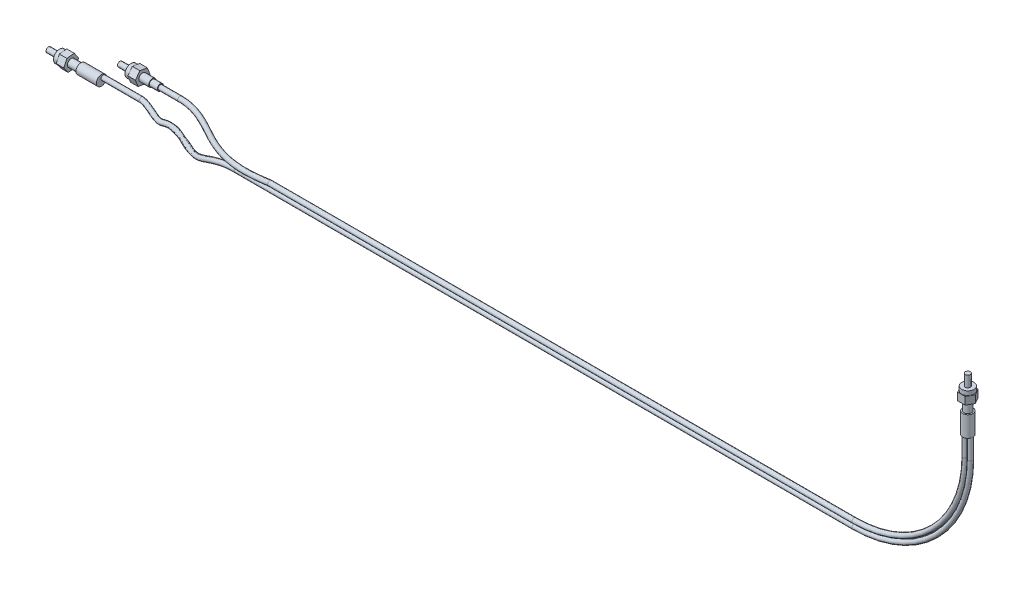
ISO-10303-21;
HEADER;
FILE_DESCRIPTION(('STEP AP214'),'2;1');
FILE_NAME('part.step','',(''),(''),'','','');
FILE_SCHEMA(('AUTOMOTIVE_DESIGN { 1 0 10303 214 1 1 1 1 }'));
ENDSEC;
DATA;
#1=APPLICATION_CONTEXT('core data for automotive mechanical design processes');
#2=APPLICATION_PROTOCOL_DEFINITION('international standard','automotive_design',2000,#1);
#3=PRODUCT_CONTEXT('',#1,'mechanical');
#4=PRODUCT('Part','Part','',(#3));
#5=PRODUCT_RELATED_PRODUCT_CATEGORY('part','',(#4));
#6=PRODUCT_DEFINITION_FORMATION('','',#4);
#7=PRODUCT_DEFINITION_CONTEXT('part definition',#1,'design');
#8=PRODUCT_DEFINITION('design','',#6,#7);
#9=PRODUCT_DEFINITION_SHAPE('','',#8);
#10=(LENGTH_UNIT() NAMED_UNIT(*) SI_UNIT(.MILLI.,.METRE.));
#11=(NAMED_UNIT(*) PLANE_ANGLE_UNIT() SI_UNIT($,.RADIAN.));
#12=(NAMED_UNIT(*) SI_UNIT($,.STERADIAN.) SOLID_ANGLE_UNIT());
#13=UNCERTAINTY_MEASURE_WITH_UNIT(LENGTH_MEASURE(1.E-05),#10,'distance_accuracy_value','');
#14=(GEOMETRIC_REPRESENTATION_CONTEXT(3) GLOBAL_UNCERTAINTY_ASSIGNED_CONTEXT((#13)) GLOBAL_UNIT_ASSIGNED_CONTEXT((#10,
#11,#12)) REPRESENTATION_CONTEXT('',''));
#15=CARTESIAN_POINT('',(0.,0.,0.));
#16=DIRECTION('',(0.,0.,1.));
#17=DIRECTION('',(1.,0.,0.));
#18=AXIS2_PLACEMENT_3D('',#15,#16,#17);
#19=CARTESIAN_POINT('',(-523.833450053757,-93.9745374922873,-3.67444092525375));
#20=DIRECTION('',(-1.,0.,0.));
#21=DIRECTION('',(0.,0.,1.));
#22=AXIS2_PLACEMENT_3D('',#19,#20,#21);
#23=PLANE('',#22);
#24=CARTESIAN_POINT('',(-523.833450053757,-93.9745374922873,-3.67444092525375));
#25=DIRECTION('',(-1.,0.,0.));
#26=DIRECTION('',(0.,0.,1.));
#27=AXIS2_PLACEMENT_3D('',#24,#25,#26);
#28=CIRCLE('',#27,3.81);
#29=CARTESIAN_POINT('',(-523.833450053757,-93.9745374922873,0.13555907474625));
#30=VERTEX_POINT('',#29);
#31=EDGE_CURVE('E845',#30,#30,#28,.T.);
#32=ORIENTED_EDGE('',*,*,#31,.T.);
#33=EDGE_LOOP('',(#32));
#34=FACE_BOUND('',#33,.T.);
#35=CARTESIAN_POINT('',(-523.833450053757,-93.9745374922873,-3.67444092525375));
#36=DIRECTION('',(-1.,0.,0.));
#37=DIRECTION('',(0.,0.,1.));
#38=AXIS2_PLACEMENT_3D('',#35,#36,#37);
#39=CIRCLE('',#38,1.5748);
#40=CARTESIAN_POINT('',(-523.833450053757,-93.9745374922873,-2.09964092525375));
#41=VERTEX_POINT('',#40);
#42=EDGE_CURVE('E842',#41,#41,#39,.T.);
#43=ORIENTED_EDGE('',*,*,#42,.F.);
#44=EDGE_LOOP('',(#43));
#45=FACE_BOUND('',#44,.T.);
#46=ADVANCED_FACE('F74',(#34,#45),#23,.T.);
#47=CARTESIAN_POINT('',(-521.293450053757,-98.2737199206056,-5.36432182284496));
#48=DIRECTION('',(-1.,0.,0.));
#49=DIRECTION('',(0.,0.,1.));
#50=AXIS2_PLACEMENT_3D('',#47,#48,#49);
#51=PLANE('',#50);
#52=DIRECTION('',(0.,-0.782155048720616,0.623083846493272));
#53=VECTOR('',#52,1.);
#54=CARTESIAN_POINT('',(-521.293450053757,-94.6606489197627,-8.24258257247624));
#55=LINE('',#54,#53);
#56=CARTESIAN_POINT('',(-521.293450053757,-94.6606489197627,-8.24258257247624));
#57=VERTEX_POINT('',#56);
#58=CARTESIAN_POINT('',(-521.293450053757,-98.2737199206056,-5.36432182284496));
#59=VERTEX_POINT('',#58);
#60=EDGE_CURVE('E852',#57,#59,#55,.T.);
#61=ORIENTED_EDGE('',*,*,#60,.T.);
#62=DIRECTION('',(0.,0.148528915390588,0.988908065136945));
#63=VECTOR('',#62,1.);
#64=CARTESIAN_POINT('',(-521.293450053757,-98.2737199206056,-5.36432182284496));
#65=LINE('',#64,#63);
#66=CARTESIAN_POINT('',(-521.293450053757,-97.5876084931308,-0.796180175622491));
#67=VERTEX_POINT('',#66);
#68=EDGE_CURVE('E855',#59,#67,#65,.T.);
#69=ORIENTED_EDGE('',*,*,#68,.T.);
#70=DIRECTION('',(0.,0.930683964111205,0.365824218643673));
#71=VECTOR('',#70,1.);
#72=CARTESIAN_POINT('',(-521.293450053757,-97.5876084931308,-0.796180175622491));
#73=LINE('',#72,#71);
#74=CARTESIAN_POINT('',(-521.293450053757,-93.288426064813,0.893700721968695));
#75=VERTEX_POINT('',#74);
#76=EDGE_CURVE('E859',#67,#75,#73,.T.);
#77=ORIENTED_EDGE('',*,*,#76,.T.);
#78=DIRECTION('',(0.,0.782155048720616,-0.623083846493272));
#79=VECTOR('',#78,1.);
#80=CARTESIAN_POINT('',(-521.293450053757,-93.288426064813,0.893700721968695));
#81=LINE('',#80,#79);
#82=CARTESIAN_POINT('',(-521.293450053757,-89.6753550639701,-1.98456002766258));
#83=VERTEX_POINT('',#82);
#84=EDGE_CURVE('E862',#75,#83,#81,.T.);
#85=ORIENTED_EDGE('',*,*,#84,.T.);
#86=DIRECTION('',(0.,-0.148528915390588,-0.988908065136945));
#87=VECTOR('',#86,1.);
#88=CARTESIAN_POINT('',(-521.293450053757,-89.6753550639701,-1.98456002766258));
#89=LINE('',#88,#87);
#90=CARTESIAN_POINT('',(-521.293450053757,-90.361466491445,-6.55270167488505));
#91=VERTEX_POINT('',#90);
#92=EDGE_CURVE('E865',#83,#91,#89,.T.);
#93=ORIENTED_EDGE('',*,*,#92,.T.);
#94=DIRECTION('',(0.,-0.930683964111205,-0.365824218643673));
#95=VECTOR('',#94,1.);
#96=CARTESIAN_POINT('',(-521.293450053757,-90.361466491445,-6.55270167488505));
#97=LINE('',#96,#95);
#98=EDGE_CURVE('E868',#91,#57,#97,.T.);
#99=ORIENTED_EDGE('',*,*,#98,.T.);
#100=EDGE_LOOP('',(#61,#69,#77,#85,#93,#99));
#101=FACE_BOUND('',#100,.T.);
#102=CARTESIAN_POINT('',(-521.293450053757,-93.9745374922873,-3.67444092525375));
#103=DIRECTION('',(-1.,0.,0.));
#104=DIRECTION('',(0.,0.,1.));
#105=AXIS2_PLACEMENT_3D('',#102,#103,#104);
#106=CIRCLE('',#105,3.81);
#107=CARTESIAN_POINT('',(-521.293450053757,-93.9745374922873,0.13555907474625));
#108=VERTEX_POINT('',#107);
#109=EDGE_CURVE('E841',#108,#108,#106,.T.);
#110=ORIENTED_EDGE('',*,*,#109,.F.);
#111=EDGE_LOOP('',(#110));
#112=FACE_BOUND('',#111,.T.);
#113=ADVANCED_FACE('F257',(#101,#112),#51,.T.);
#114=CARTESIAN_POINT('',(-581.608917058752,-121.824590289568,-17.0288158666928));
#115=DIRECTION('',(-1.,0.,0.));
#116=DIRECTION('',(0.,0.,1.));
#117=AXIS2_PLACEMENT_3D('',#114,#115,#116);
#118=PLANE('',#117);
#119=CARTESIAN_POINT('',(-581.608917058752,-121.824590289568,-17.0288158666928));
#120=DIRECTION('',(-1.,0.,0.));
#121=DIRECTION('',(0.,0.,1.));
#122=AXIS2_PLACEMENT_3D('',#119,#120,#121);
#123=CIRCLE('',#122,3.81000000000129);
#124=CARTESIAN_POINT('',(-581.608917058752,-121.824590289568,-13.2188158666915));
#125=VERTEX_POINT('',#124);
#126=EDGE_CURVE('E924',#125,#125,#123,.T.);
#127=ORIENTED_EDGE('',*,*,#126,.T.);
#128=EDGE_LOOP('',(#127));
#129=FACE_BOUND('',#128,.T.);
#130=CARTESIAN_POINT('',(-581.608917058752,-121.824590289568,-17.0288158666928));
#131=DIRECTION('',(-1.,0.,0.));
#132=DIRECTION('',(0.,0.,1.));
#133=AXIS2_PLACEMENT_3D('',#130,#131,#132);
#134=CIRCLE('',#133,1.57480000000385);
#135=CARTESIAN_POINT('',(-581.608917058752,-121.824590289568,-15.454015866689));
#136=VERTEX_POINT('',#135);
#137=EDGE_CURVE('E915',#136,#136,#134,.T.);
#138=ORIENTED_EDGE('',*,*,#137,.F.);
#139=EDGE_LOOP('',(#138));
#140=FACE_BOUND('',#139,.T.);
#141=ADVANCED_FACE('F263',(#129,#140),#118,.T.);
#142=CARTESIAN_POINT('',(-579.068917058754,-126.029667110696,-15.1167499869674));
#143=DIRECTION('',(-1.,0.,0.));
#144=DIRECTION('',(0.,0.,1.));
#145=AXIS2_PLACEMENT_3D('',#142,#143,#144);
#146=PLANE('',#145);
#147=DIRECTION('',(0.,-0.0966884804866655,0.995314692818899));
#148=VECTOR('',#147,1.);
#149=CARTESIAN_POINT('',(-579.068917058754,-125.583026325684,-19.7144862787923));
#150=LINE('',#149,#148);
#151=CARTESIAN_POINT('',(-579.068917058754,-125.583026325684,-19.7144862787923));
#152=VERTEX_POINT('',#151);
#153=CARTESIAN_POINT('',(-579.068917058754,-126.029667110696,-15.1167499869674));
#154=VERTEX_POINT('',#153);
#155=EDGE_CURVE('E930',#152,#154,#150,.T.);
#156=ORIENTED_EDGE('',*,*,#155,.T.);
#157=DIRECTION('',(0.,0.813623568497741,0.581392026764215));
#158=VECTOR('',#157,1.);
#159=CARTESIAN_POINT('',(-579.068917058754,-126.029667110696,-15.1167499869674));
#160=LINE('',#159,#158);
#161=CARTESIAN_POINT('',(-579.068917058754,-122.27123107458,-12.4310795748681));
#162=VERTEX_POINT('',#161);
#163=EDGE_CURVE('E933',#154,#162,#160,.T.);
#164=ORIENTED_EDGE('',*,*,#163,.T.);
#165=DIRECTION('',(0.,0.910312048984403,-0.413922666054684));
#166=VECTOR('',#165,1.);
#167=CARTESIAN_POINT('',(-579.068917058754,-122.27123107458,-12.4310795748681));
#168=LINE('',#167,#166);
#169=CARTESIAN_POINT('',(-579.068917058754,-118.066154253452,-14.3431454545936));
#170=VERTEX_POINT('',#169);
#171=EDGE_CURVE('E937',#162,#170,#168,.T.);
#172=ORIENTED_EDGE('',*,*,#171,.T.);
#173=DIRECTION('',(0.,0.0966884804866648,-0.995314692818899));
#174=VECTOR('',#173,1.);
#175=CARTESIAN_POINT('',(-579.068917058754,-118.066154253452,-14.3431454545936));
#176=LINE('',#175,#174);
#177=CARTESIAN_POINT('',(-579.068917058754,-117.61951346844,-18.9408817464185));
#178=VERTEX_POINT('',#177);
#179=EDGE_CURVE('E940',#170,#178,#176,.T.);
#180=ORIENTED_EDGE('',*,*,#179,.T.);
#181=DIRECTION('',(0.,-0.813623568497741,-0.581392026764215));
#182=VECTOR('',#181,1.);
#183=CARTESIAN_POINT('',(-579.068917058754,-117.61951346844,-18.9408817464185));
#184=LINE('',#183,#182);
#185=CARTESIAN_POINT('',(-579.068917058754,-121.377949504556,-21.6265521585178));
#186=VERTEX_POINT('',#185);
#187=EDGE_CURVE('E943',#178,#186,#184,.T.);
#188=ORIENTED_EDGE('',*,*,#187,.T.);
#189=DIRECTION('',(0.,-0.910312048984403,0.413922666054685));
#190=VECTOR('',#189,1.);
#191=CARTESIAN_POINT('',(-579.068917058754,-121.377949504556,-21.6265521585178));
#192=LINE('',#191,#190);
#193=EDGE_CURVE('E946',#186,#152,#192,.T.);
#194=ORIENTED_EDGE('',*,*,#193,.T.);
#195=EDGE_LOOP('',(#156,#164,#172,#180,#188,#194));
#196=FACE_BOUND('',#195,.T.);
#197=CARTESIAN_POINT('',(-579.068917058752,-121.824590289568,-17.0288158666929));
#198=DIRECTION('',(-1.,0.,0.));
#199=DIRECTION('',(0.,0.,1.));
#200=AXIS2_PLACEMENT_3D('',#197,#198,#199);
#201=CIRCLE('',#200,3.81000000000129);
#202=CARTESIAN_POINT('',(-579.068917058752,-121.824590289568,-13.2188158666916));
#203=VERTEX_POINT('',#202);
#204=EDGE_CURVE('E921',#203,#203,#201,.T.);
#205=ORIENTED_EDGE('',*,*,#204,.F.);
#206=EDGE_LOOP('',(#205));
#207=FACE_BOUND('',#206,.T.);
#208=ADVANCED_FACE('F331',(#196,#207),#146,.T.);
#209=CARTESIAN_POINT('',(-568.273917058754,-121.824590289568,-17.0288158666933));
#210=DIRECTION('',(-1.,0.,0.));
#211=DIRECTION('',(0.,0.,1.));
#212=AXIS2_PLACEMENT_3D('',#209,#210,#211);
#213=PLANE('',#212);
#214=CARTESIAN_POINT('',(-568.273917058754,-121.824590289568,-17.0288158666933));
#215=DIRECTION('',(-1.,0.,0.));
#216=DIRECTION('',(0.,0.,1.));
#217=AXIS2_PLACEMENT_3D('',#214,#215,#216);
#218=CIRCLE('',#217,3.16230000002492);
#219=CARTESIAN_POINT('',(-568.273917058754,-121.824590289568,-13.8665158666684));
#220=VERTEX_POINT('',#219);
#221=EDGE_CURVE('E990',#220,#220,#218,.T.);
#222=ORIENTED_EDGE('',*,*,#221,.T.);
#223=EDGE_LOOP('',(#222));
#224=FACE_BOUND('',#223,.T.);
#225=CARTESIAN_POINT('',(-568.273917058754,-121.824590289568,-17.0288158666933));
#226=DIRECTION('',(-1.,0.,0.));
#227=DIRECTION('',(0.,0.,1.));
#228=AXIS2_PLACEMENT_3D('',#225,#226,#227);
#229=CIRCLE('',#228,2.34950000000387);
#230=CARTESIAN_POINT('',(-568.273917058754,-121.824590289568,-19.3783158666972));
#231=VERTEX_POINT('',#230);
#232=EDGE_CURVE('E983',#231,#231,#229,.T.);
#233=ORIENTED_EDGE('',*,*,#232,.F.);
#234=EDGE_LOOP('',(#233));
#235=FACE_BOUND('',#234,.T.);
#236=ADVANCED_FACE('F339',(#224,#235),#213,.T.);
#237=CARTESIAN_POINT('',(4.61937950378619,-7.239,0.));
#238=DIRECTION('',(0.,-1.,0.));
#239=DIRECTION('',(0.,0.,-1.));
#240=AXIS2_PLACEMENT_3D('',#237,#238,#239);
#241=PLANE('',#240);
#242=DIRECTION('',(0.5,0.,0.866025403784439));
#243=VECTOR('',#242,1.);
#244=CARTESIAN_POINT('',(2.3096897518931,-7.239,-4.0005));
#245=LINE('',#244,#243);
#246=CARTESIAN_POINT('',(2.3096897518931,-7.239,-4.0005));
#247=VERTEX_POINT('',#246);
#248=CARTESIAN_POINT('',(4.6193795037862,-7.239,0.));
#249=VERTEX_POINT('',#248);
#250=EDGE_CURVE('E186',#247,#249,#245,.T.);
#251=ORIENTED_EDGE('',*,*,#250,.T.);
#252=DIRECTION('',(-0.5,0.,0.866025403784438));
#253=VECTOR('',#252,1.);
#254=CARTESIAN_POINT('',(4.6193795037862,-7.239,0.));
#255=LINE('',#254,#253);
#256=CARTESIAN_POINT('',(2.3096897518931,-7.239,4.0005));
#257=VERTEX_POINT('',#256);
#258=EDGE_CURVE('E136',#249,#257,#255,.T.);
#259=ORIENTED_EDGE('',*,*,#258,.T.);
#260=DIRECTION('',(-1.,0.,0.));
#261=VECTOR('',#260,1.);
#262=CARTESIAN_POINT('',(2.3096897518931,-7.239,4.0005));
#263=LINE('',#262,#261);
#264=CARTESIAN_POINT('',(-2.3096897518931,-7.239,4.0005));
#265=VERTEX_POINT('',#264);
#266=EDGE_CURVE('E153',#257,#265,#263,.T.);
#267=ORIENTED_EDGE('',*,*,#266,.T.);
#268=DIRECTION('',(-0.5,0.,-0.866025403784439));
#269=VECTOR('',#268,1.);
#270=CARTESIAN_POINT('',(-2.3096897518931,-7.239,4.0005));
#271=LINE('',#270,#269);
#272=CARTESIAN_POINT('',(-4.6193795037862,-7.239,0.));
#273=VERTEX_POINT('',#272);
#274=EDGE_CURVE('E145',#265,#273,#271,.T.);
#275=ORIENTED_EDGE('',*,*,#274,.T.);
#276=DIRECTION('',(0.5,0.,-0.866025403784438));
#277=VECTOR('',#276,1.);
#278=CARTESIAN_POINT('',(-4.6193795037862,-7.239,0.));
#279=LINE('',#278,#277);
#280=CARTESIAN_POINT('',(-2.3096897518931,-7.239,-4.0005));
#281=VERTEX_POINT('',#280);
#282=EDGE_CURVE('E150',#273,#281,#279,.T.);
#283=ORIENTED_EDGE('',*,*,#282,.T.);
#284=DIRECTION('',(1.,0.,0.));
#285=VECTOR('',#284,1.);
#286=CARTESIAN_POINT('',(-2.3096897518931,-7.239,-4.0005));
#287=LINE('',#286,#285);
#288=EDGE_CURVE('E100',#281,#247,#287,.T.);
#289=ORIENTED_EDGE('',*,*,#288,.T.);
#290=EDGE_LOOP('',(#251,#259,#267,#275,#283,#289));
#291=FACE_BOUND('',#290,.T.);
#292=CARTESIAN_POINT('',(0.,-7.239,0.));
#293=DIRECTION('',(0.,-1.,0.));
#294=DIRECTION('',(0.,0.,-1.));
#295=AXIS2_PLACEMENT_3D('',#292,#293,#294);
#296=CIRCLE('',#295,2.3495);
#297=CARTESIAN_POINT('',(0.,-7.239,2.3495));
#298=VERTEX_POINT('',#297);
#299=EDGE_CURVE('E225',#298,#298,#296,.T.);
#300=ORIENTED_EDGE('',*,*,#299,.F.);
#301=EDGE_LOOP('',(#300));
#302=FACE_BOUND('',#301,.T.);
#303=ADVANCED_FACE('F147',(#291,#302),#241,.T.);
#304=CARTESIAN_POINT('',(0.,0.,0.));
#305=DIRECTION('',(0.,1.,0.));
#306=DIRECTION('',(0.,0.,1.));
#307=AXIS2_PLACEMENT_3D('',#304,#305,#306);
#308=PLANE('',#307);
#309=CARTESIAN_POINT('',(0.,0.,0.));
#310=DIRECTION('',(0.,1.,0.));
#311=DIRECTION('',(0.,0.,1.));
#312=AXIS2_PLACEMENT_3D('',#309,#310,#311);
#313=CIRCLE('',#312,3.81);
#314=CARTESIAN_POINT('',(0.,0.,3.81));
#315=VERTEX_POINT('',#314);
#316=EDGE_CURVE('E202',#315,#315,#313,.T.);
#317=ORIENTED_EDGE('',*,*,#316,.T.);
#318=EDGE_LOOP('',(#317));
#319=FACE_BOUND('',#318,.T.);
#320=CARTESIAN_POINT('',(0.,0.,0.));
#321=DIRECTION('',(0.,1.,0.));
#322=DIRECTION('',(0.,0.,1.));
#323=AXIS2_PLACEMENT_3D('',#320,#321,#322);
#324=CIRCLE('',#323,1.5748);
#325=CARTESIAN_POINT('',(0.,0.,1.5748));
#326=VERTEX_POINT('',#325);
#327=EDGE_CURVE('E198',#326,#326,#324,.T.);
#328=ORIENTED_EDGE('',*,*,#327,.F.);
#329=EDGE_LOOP('',(#328));
#330=FACE_BOUND('',#329,.T.);
#331=ADVANCED_FACE('F435',(#319,#330),#308,.T.);
#332=CARTESIAN_POINT('',(0.,-2.54,0.));
#333=DIRECTION('',(0.,1.,0.));
#334=DIRECTION('',(0.,0.,1.));
#335=AXIS2_PLACEMENT_3D('',#332,#333,#334);
#336=CYLINDRICAL_SURFACE('',#335,3.81);
#337=CARTESIAN_POINT('',(0.,-2.54,0.));
#338=DIRECTION('',(0.,-1.,0.));
#339=DIRECTION('',(0.,0.,-1.));
#340=AXIS2_PLACEMENT_3D('',#337,#338,#339);
#341=CIRCLE('',#340,3.81);
#342=CARTESIAN_POINT('',(0.,-2.54,-3.81));
#343=VERTEX_POINT('',#342);
#344=EDGE_CURVE('E195',#343,#343,#341,.F.);
#345=ORIENTED_EDGE('',*,*,#344,.T.);
#346=EDGE_LOOP('',(#345));
#347=FACE_BOUND('',#346,.T.);
#348=ORIENTED_EDGE('',*,*,#316,.F.);
#349=EDGE_LOOP('',(#348));
#350=FACE_BOUND('',#349,.T.);
#351=ADVANCED_FACE('F76',(#347,#350),#336,.T.);
#352=CARTESIAN_POINT('',(0.,6.858,0.));
#353=DIRECTION('',(0.,-1.,0.));
#354=DIRECTION('',(0.,0.,-1.));
#355=AXIS2_PLACEMENT_3D('',#352,#353,#354);
#356=CYLINDRICAL_SURFACE('',#355,1.5748);
#357=CARTESIAN_POINT('',(0.,6.858,0.));
#358=DIRECTION('',(0.,1.,0.));
#359=DIRECTION('',(0.,0.,1.));
#360=AXIS2_PLACEMENT_3D('',#357,#358,#359);
#361=CIRCLE('',#360,1.5748);
#362=CARTESIAN_POINT('',(0.,6.858,1.5748));
#363=VERTEX_POINT('',#362);
#364=EDGE_CURVE('E199',#363,#363,#361,.T.);
#365=ORIENTED_EDGE('',*,*,#364,.F.);
#366=EDGE_LOOP('',(#365));
#367=FACE_BOUND('',#366,.T.);
#368=ORIENTED_EDGE('',*,*,#327,.T.);
#369=EDGE_LOOP('',(#368));
#370=FACE_BOUND('',#369,.T.);
#371=ADVANCED_FACE('F253',(#367,#370),#356,.T.);
#372=CARTESIAN_POINT('',(0.,6.858,0.));
#373=DIRECTION('',(0.,1.,0.));
#374=DIRECTION('',(0.,0.,1.));
#375=AXIS2_PLACEMENT_3D('',#372,#373,#374);
#376=PLANE('',#375);
#377=ORIENTED_EDGE('',*,*,#364,.T.);
#378=EDGE_LOOP('',(#377));
#379=FACE_BOUND('',#378,.T.);
#380=ADVANCED_FACE('F246',(#379),#376,.T.);
#381=CARTESIAN_POINT('',(2.3096897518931,-7.239,-4.0005));
#382=DIRECTION('',(-0.866025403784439,0.,0.5));
#383=DIRECTION('',(0.5,0.,0.866025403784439));
#384=AXIS2_PLACEMENT_3D('',#381,#382,#383);
#385=PLANE('',#384);
#386=DIRECTION('',(0.5,0.,0.866025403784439));
#387=VECTOR('',#386,1.);
#388=CARTESIAN_POINT('',(2.3096897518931,-2.54,-4.0005));
#389=LINE('',#388,#387);
#390=CARTESIAN_POINT('',(2.3096897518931,-2.54,-4.0005));
#391=VERTEX_POINT('',#390);
#392=CARTESIAN_POINT('',(4.6193795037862,-2.54,0.));
#393=VERTEX_POINT('',#392);
#394=EDGE_CURVE('E174',#391,#393,#389,.T.);
#395=ORIENTED_EDGE('',*,*,#394,.T.);
#396=DIRECTION('',(0.,1.,0.));
#397=VECTOR('',#396,1.);
#398=CARTESIAN_POINT('',(4.6193795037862,-7.239,0.));
#399=LINE('',#398,#397);
#400=EDGE_CURVE('E193',#249,#393,#399,.T.);
#401=ORIENTED_EDGE('',*,*,#400,.F.);
#402=ORIENTED_EDGE('',*,*,#250,.F.);
#403=DIRECTION('',(0.,1.,0.));
#404=VECTOR('',#403,1.);
#405=CARTESIAN_POINT('',(2.3096897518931,-7.239,-4.0005));
#406=LINE('',#405,#404);
#407=EDGE_CURVE('E170',#247,#391,#406,.T.);
#408=ORIENTED_EDGE('',*,*,#407,.T.);
#409=EDGE_LOOP('',(#395,#401,#402,#408));
#410=FACE_BOUND('',#409,.T.);
#411=ADVANCED_FACE('F244',(#410),#385,.F.);
#412=CARTESIAN_POINT('',(4.6193795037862,-7.239,0.));
#413=DIRECTION('',(-0.866025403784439,0.,-0.5));
#414=DIRECTION('',(-0.5,0.,0.866025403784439));
#415=AXIS2_PLACEMENT_3D('',#412,#413,#414);
#416=PLANE('',#415);
#417=DIRECTION('',(-0.5,0.,0.866025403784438));
#418=VECTOR('',#417,1.);
#419=CARTESIAN_POINT('',(4.6193795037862,-2.54,0.));
#420=LINE('',#419,#418);
#421=CARTESIAN_POINT('',(2.3096897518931,-2.54,4.0005));
#422=VERTEX_POINT('',#421);
#423=EDGE_CURVE('E177',#393,#422,#420,.T.);
#424=ORIENTED_EDGE('',*,*,#423,.T.);
#425=DIRECTION('',(0.,1.,0.));
#426=VECTOR('',#425,1.);
#427=CARTESIAN_POINT('',(2.3096897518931,-7.239,4.0005));
#428=LINE('',#427,#426);
#429=EDGE_CURVE('E190',#257,#422,#428,.T.);
#430=ORIENTED_EDGE('',*,*,#429,.F.);
#431=ORIENTED_EDGE('',*,*,#258,.F.);
#432=ORIENTED_EDGE('',*,*,#400,.T.);
#433=EDGE_LOOP('',(#424,#430,#431,#432));
#434=FACE_BOUND('',#433,.T.);
#435=ADVANCED_FACE('F235',(#434),#416,.F.);
#436=CARTESIAN_POINT('',(2.3096897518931,-7.239,4.0005));
#437=DIRECTION('',(0.,0.,-1.));
#438=DIRECTION('',(-1.,0.,0.));
#439=AXIS2_PLACEMENT_3D('',#436,#437,#438);
#440=PLANE('',#439);
#441=DIRECTION('',(-1.,0.,0.));
#442=VECTOR('',#441,1.);
#443=CARTESIAN_POINT('',(2.3096897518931,-2.54,4.0005));
#444=LINE('',#443,#442);
#445=CARTESIAN_POINT('',(-2.3096897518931,-2.54,4.0005));
#446=VERTEX_POINT('',#445);
#447=EDGE_CURVE('E180',#422,#446,#444,.T.);
#448=ORIENTED_EDGE('',*,*,#447,.T.);
#449=DIRECTION('',(0.,1.,0.));
#450=VECTOR('',#449,1.);
#451=CARTESIAN_POINT('',(-2.3096897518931,-7.239,4.0005));
#452=LINE('',#451,#450);
#453=EDGE_CURVE('E165',#265,#446,#452,.T.);
#454=ORIENTED_EDGE('',*,*,#453,.F.);
#455=ORIENTED_EDGE('',*,*,#266,.F.);
#456=ORIENTED_EDGE('',*,*,#429,.T.);
#457=EDGE_LOOP('',(#448,#454,#455,#456));
#458=FACE_BOUND('',#457,.T.);
#459=ADVANCED_FACE('F238',(#458),#440,.F.);
#460=CARTESIAN_POINT('',(-2.3096897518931,-7.239,4.0005));
#461=DIRECTION('',(0.866025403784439,0.,-0.5));
#462=DIRECTION('',(-0.5,0.,-0.866025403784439));
#463=AXIS2_PLACEMENT_3D('',#460,#461,#462);
#464=PLANE('',#463);
#465=DIRECTION('',(-0.5,0.,-0.866025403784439));
#466=VECTOR('',#465,1.);
#467=CARTESIAN_POINT('',(-2.3096897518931,-2.54,4.0005));
#468=LINE('',#467,#466);
#469=CARTESIAN_POINT('',(-4.6193795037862,-2.54,0.));
#470=VERTEX_POINT('',#469);
#471=EDGE_CURVE('E162',#446,#470,#468,.T.);
#472=ORIENTED_EDGE('',*,*,#471,.T.);
#473=DIRECTION('',(0.,1.,0.));
#474=VECTOR('',#473,1.);
#475=CARTESIAN_POINT('',(-4.6193795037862,-7.239,0.));
#476=LINE('',#475,#474);
#477=EDGE_CURVE('E159',#273,#470,#476,.T.);
#478=ORIENTED_EDGE('',*,*,#477,.F.);
#479=ORIENTED_EDGE('',*,*,#274,.F.);
#480=ORIENTED_EDGE('',*,*,#453,.T.);
#481=EDGE_LOOP('',(#472,#478,#479,#480));
#482=FACE_BOUND('',#481,.T.);
#483=ADVANCED_FACE('F160',(#482),#464,.F.);
#484=CARTESIAN_POINT('',(-4.6193795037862,-7.239,0.));
#485=DIRECTION('',(0.866025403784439,0.,0.5));
#486=DIRECTION('',(0.5,0.,-0.866025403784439));
#487=AXIS2_PLACEMENT_3D('',#484,#485,#486);
#488=PLANE('',#487);
#489=DIRECTION('',(0.5,0.,-0.866025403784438));
#490=VECTOR('',#489,1.);
#491=CARTESIAN_POINT('',(-4.6193795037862,-2.54,0.));
#492=LINE('',#491,#490);
#493=CARTESIAN_POINT('',(-2.3096897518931,-2.54,-4.0005));
#494=VERTEX_POINT('',#493);
#495=EDGE_CURVE('E183',#470,#494,#492,.T.);
#496=ORIENTED_EDGE('',*,*,#495,.T.);
#497=DIRECTION('',(0.,1.,0.));
#498=VECTOR('',#497,1.);
#499=CARTESIAN_POINT('',(-2.3096897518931,-7.239,-4.0005));
#500=LINE('',#499,#498);
#501=EDGE_CURVE('E166',#281,#494,#500,.T.);
#502=ORIENTED_EDGE('',*,*,#501,.F.);
#503=ORIENTED_EDGE('',*,*,#282,.F.);
#504=ORIENTED_EDGE('',*,*,#477,.T.);
#505=EDGE_LOOP('',(#496,#502,#503,#504));
#506=FACE_BOUND('',#505,.T.);
#507=ADVANCED_FACE('F168',(#506),#488,.F.);
#508=CARTESIAN_POINT('',(-2.3096897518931,-7.239,-4.0005));
#509=DIRECTION('',(0.,0.,1.));
#510=DIRECTION('',(1.,0.,0.));
#511=AXIS2_PLACEMENT_3D('',#508,#509,#510);
#512=PLANE('',#511);
#513=DIRECTION('',(1.,0.,0.));
#514=VECTOR('',#513,1.);
#515=CARTESIAN_POINT('',(-2.3096897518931,-2.54,-4.0005));
#516=LINE('',#515,#514);
#517=EDGE_CURVE('E127',#494,#391,#516,.T.);
#518=ORIENTED_EDGE('',*,*,#517,.T.);
#519=ORIENTED_EDGE('',*,*,#407,.F.);
#520=ORIENTED_EDGE('',*,*,#288,.F.);
#521=ORIENTED_EDGE('',*,*,#501,.T.);
#522=EDGE_LOOP('',(#518,#519,#520,#521));
#523=FACE_BOUND('',#522,.T.);
#524=ADVANCED_FACE('F242',(#523),#512,.F.);
#525=CARTESIAN_POINT('',(4.61937950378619,-2.54,0.));
#526=DIRECTION('',(0.,-1.,0.));
#527=DIRECTION('',(0.,0.,-1.));
#528=AXIS2_PLACEMENT_3D('',#525,#526,#527);
#529=PLANE('',#528);
#530=ORIENTED_EDGE('',*,*,#344,.F.);
#531=EDGE_LOOP('',(#530));
#532=FACE_BOUND('',#531,.T.);
#533=ORIENTED_EDGE('',*,*,#394,.F.);
#534=ORIENTED_EDGE('',*,*,#517,.F.);
#535=ORIENTED_EDGE('',*,*,#495,.F.);
#536=ORIENTED_EDGE('',*,*,#471,.F.);
#537=ORIENTED_EDGE('',*,*,#447,.F.);
#538=ORIENTED_EDGE('',*,*,#423,.F.);
#539=EDGE_LOOP('',(#533,#534,#535,#536,#537,#538));
#540=FACE_BOUND('',#539,.T.);
#541=ADVANCED_FACE('F241',(#532,#540),#529,.F.);
#542=CARTESIAN_POINT('',(0.,-13.335,0.));
#543=DIRECTION('',(0.,1.,0.));
#544=DIRECTION('',(0.,0.,1.));
#545=AXIS2_PLACEMENT_3D('',#542,#543,#544);
#546=CYLINDRICAL_SURFACE('',#545,2.3495);
#547=CARTESIAN_POINT('',(0.,-13.335,0.));
#548=DIRECTION('',(0.,-1.,0.));
#549=DIRECTION('',(0.,0.,-1.));
#550=AXIS2_PLACEMENT_3D('',#547,#548,#549);
#551=CIRCLE('',#550,2.3495);
#552=CARTESIAN_POINT('',(0.,-13.335,2.3495));
#553=VERTEX_POINT('',#552);
#554=EDGE_CURVE('E178',#553,#553,#551,.T.);
#555=CARTESIAN_POINT('',(0.,-13.335,2.3495));
#556=CARTESIAN_POINT('',(0.,-13.2715,2.3495));
#557=CARTESIAN_POINT('',(0.,-13.208,2.3495));
#558=CARTESIAN_POINT('',(0.,-13.081,2.3495));
#559=CARTESIAN_POINT('',(0.,-13.0175,2.3495));
#560=CARTESIAN_POINT('',(0.,-12.8905,2.3495));
#561=CARTESIAN_POINT('',(0.,-12.827,2.3495));
#562=CARTESIAN_POINT('',(0.,-12.7,2.3495));
#563=CARTESIAN_POINT('',(0.,-12.6365,2.3495));
#564=CARTESIAN_POINT('',(0.,-12.5095,2.3495));
#565=CARTESIAN_POINT('',(0.,-12.446,2.3495));
#566=CARTESIAN_POINT('',(0.,-12.319,2.3495));
#567=CARTESIAN_POINT('',(0.,-12.2555,2.3495));
#568=CARTESIAN_POINT('',(0.,-12.1285,2.3495));
#569=CARTESIAN_POINT('',(0.,-12.065,2.3495));
#570=CARTESIAN_POINT('',(0.,-11.938,2.3495));
#571=CARTESIAN_POINT('',(0.,-11.8745,2.3495));
#572=CARTESIAN_POINT('',(0.,-11.7475,2.3495));
#573=CARTESIAN_POINT('',(0.,-11.684,2.3495));
#574=CARTESIAN_POINT('',(0.,-11.557,2.3495));
#575=CARTESIAN_POINT('',(0.,-11.4935,2.3495));
#576=CARTESIAN_POINT('',(0.,-11.3665,2.3495));
#577=CARTESIAN_POINT('',(0.,-11.303,2.3495));
#578=CARTESIAN_POINT('',(0.,-11.176,2.3495));
#579=CARTESIAN_POINT('',(0.,-11.1125,2.3495));
#580=CARTESIAN_POINT('',(0.,-10.9855,2.3495));
#581=CARTESIAN_POINT('',(0.,-10.922,2.3495));
#582=CARTESIAN_POINT('',(0.,-10.795,2.3495));
#583=CARTESIAN_POINT('',(0.,-10.7315,2.3495));
#584=CARTESIAN_POINT('',(0.,-10.6045,2.3495));
#585=CARTESIAN_POINT('',(0.,-10.541,2.3495));
#586=CARTESIAN_POINT('',(0.,-10.414,2.3495));
#587=CARTESIAN_POINT('',(0.,-10.3505,2.3495));
#588=CARTESIAN_POINT('',(0.,-10.2235,2.3495));
#589=CARTESIAN_POINT('',(0.,-10.16,2.3495));
#590=CARTESIAN_POINT('',(0.,-10.033,2.3495));
#591=CARTESIAN_POINT('',(0.,-9.9695,2.3495));
#592=CARTESIAN_POINT('',(0.,-9.8425,2.3495));
#593=CARTESIAN_POINT('',(0.,-9.779,2.3495));
#594=CARTESIAN_POINT('',(0.,-9.652,2.3495));
#595=CARTESIAN_POINT('',(0.,-9.5885,2.3495));
#596=CARTESIAN_POINT('',(0.,-9.4615,2.3495));
#597=CARTESIAN_POINT('',(0.,-9.398,2.3495));
#598=CARTESIAN_POINT('',(0.,-9.271,2.3495));
#599=CARTESIAN_POINT('',(0.,-9.2075,2.3495));
#600=CARTESIAN_POINT('',(0.,-9.0805,2.3495));
#601=CARTESIAN_POINT('',(0.,-9.017,2.3495));
#602=CARTESIAN_POINT('',(0.,-8.89,2.3495));
#603=CARTESIAN_POINT('',(0.,-8.8265,2.3495));
#604=CARTESIAN_POINT('',(0.,-8.6995,2.3495));
#605=CARTESIAN_POINT('',(0.,-8.636,2.3495));
#606=CARTESIAN_POINT('',(0.,-8.509,2.3495));
#607=CARTESIAN_POINT('',(0.,-8.4455,2.3495));
#608=CARTESIAN_POINT('',(0.,-8.3185,2.3495));
#609=CARTESIAN_POINT('',(0.,-8.255,2.3495));
#610=CARTESIAN_POINT('',(0.,-8.128,2.3495));
#611=CARTESIAN_POINT('',(0.,-8.0645,2.3495));
#612=CARTESIAN_POINT('',(0.,-7.9375,2.3495));
#613=CARTESIAN_POINT('',(0.,-7.874,2.3495));
#614=CARTESIAN_POINT('',(0.,-7.747,2.3495));
#615=CARTESIAN_POINT('',(0.,-7.6835,2.3495));
#616=CARTESIAN_POINT('',(0.,-7.5565,2.3495));
#617=CARTESIAN_POINT('',(0.,-7.493,2.3495));
#618=CARTESIAN_POINT('',(0.,-7.366,2.3495));
#619=CARTESIAN_POINT('',(0.,-7.3025,2.3495));
#620=CARTESIAN_POINT('',(0.,-7.239,2.3495));
#621=B_SPLINE_CURVE_WITH_KNOTS('',3,(#555,#556,#557,#558,#559,#560,#561,#562,#563,#564,#565,
#566,#567,#568,#569,#570,#571,#572,#573,#574,#575,#576,#577,#578,#579,#580,#581,#582,#583,#584,
#585,#586,#587,#588,#589,#590,#591,#592,#593,#594,#595,#596,#597,#598,#599,#600,#601,#602,#603,
#604,#605,#606,#607,#608,#609,#610,#611,#612,#613,#614,#615,#616,#617,#618,#619,#620),
.UNSPECIFIED.,.F.,.F.,(4,2,2,2,2,2,2,2,2,2,2,2,2,2,2,2,2,2,2,2,2,2,2,2,2,2,2,2,2,2,2,2,4),(0.,
0.190500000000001,0.381000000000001,0.571500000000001,0.762000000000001,0.9525,1.143,1.3335,
1.524,1.7145,1.905,2.0955,2.286,2.4765,2.667,2.8575,3.048,3.2385,3.429,3.6195,3.81,4.0005,4.191,
4.3815,4.572,4.7625,4.953,5.1435,5.334,5.5245,5.715,5.9055,6.096),.UNSPECIFIED.);
#622=EDGE_CURVE('BSEAM425',#553,#298,#621,.T.);
#623=ORIENTED_EDGE('',*,*,#554,.F.);
#624=ORIENTED_EDGE('',*,*,#299,.T.);
#625=ORIENTED_EDGE('',*,*,#622,.T.);
#626=ORIENTED_EDGE('',*,*,#622,.F.);
#627=EDGE_LOOP('',(#623,#625,#624,#626));
#628=FACE_BOUND('',#627,.T.);
#629=ADVANCED_FACE('F425',(#628),#546,.T.);
#630=CARTESIAN_POINT('',(0.,-13.335,0.));
#631=DIRECTION('',(0.,-1.,0.));
#632=DIRECTION('',(0.,0.,-1.));
#633=AXIS2_PLACEMENT_3D('',#630,#631,#632);
#634=PLANE('',#633);
#635=CARTESIAN_POINT('',(0.,-13.335,0.));
#636=DIRECTION('',(0.,-1.,0.));
#637=DIRECTION('',(0.,0.,-1.));
#638=AXIS2_PLACEMENT_3D('',#635,#636,#637);
#639=CIRCLE('',#638,3.1623);
#640=CARTESIAN_POINT('',(0.,-13.335,-3.1623));
#641=VERTEX_POINT('',#640);
#642=EDGE_CURVE('E221',#641,#641,#639,.T.);
#643=ORIENTED_EDGE('',*,*,#642,.F.);
#644=EDGE_LOOP('',(#643));
#645=FACE_BOUND('',#644,.T.);
#646=ORIENTED_EDGE('',*,*,#554,.T.);
#647=EDGE_LOOP('',(#646));
#648=FACE_BOUND('',#647,.T.);
#649=ADVANCED_FACE('F422',(#645,#648),#634,.F.);
#650=CARTESIAN_POINT('',(0.,-26.035,0.));
#651=DIRECTION('',(0.,1.,0.));
#652=DIRECTION('',(0.,0.,1.));
#653=AXIS2_PLACEMENT_3D('',#650,#651,#652);
#654=CYLINDRICAL_SURFACE('',#653,3.1623);
#655=CARTESIAN_POINT('',(0.,-26.035,0.));
#656=DIRECTION('',(0.,-1.,0.));
#657=DIRECTION('',(0.,0.,-1.));
#658=AXIS2_PLACEMENT_3D('',#655,#656,#657);
#659=CIRCLE('',#658,3.1623);
#660=CARTESIAN_POINT('',(0.,-26.035,-3.1623));
#661=VERTEX_POINT('',#660);
#662=EDGE_CURVE('E222',#661,#661,#659,.T.);
#663=ORIENTED_EDGE('',*,*,#662,.F.);
#664=EDGE_LOOP('',(#663));
#665=FACE_BOUND('',#664,.T.);
#666=ORIENTED_EDGE('',*,*,#642,.T.);
#667=EDGE_LOOP('',(#666));
#668=FACE_BOUND('',#667,.T.);
#669=ADVANCED_FACE('F420',(#665,#668),#654,.T.);
#670=CARTESIAN_POINT('',(0.,-26.035,0.));
#671=DIRECTION('',(0.,-1.,0.));
#672=DIRECTION('',(0.,0.,-1.));
#673=AXIS2_PLACEMENT_3D('',#670,#671,#672);
#674=PLANE('',#673);
#675=CARTESIAN_POINT('',(-1.5875,-26.035,0.));
#676=DIRECTION('',(0.,-1.,0.));
#677=DIRECTION('',(0.,0.,-1.));
#678=AXIS2_PLACEMENT_3D('',#675,#676,#677);
#679=CIRCLE('',#678,1.4605);
#680=CARTESIAN_POINT('',(-1.5875,-26.035,-1.4605));
#681=VERTEX_POINT('',#680);
#682=EDGE_CURVE('E87',#681,#681,#679,.T.);
#683=ORIENTED_EDGE('',*,*,#682,.F.);
#684=EDGE_LOOP('',(#683));
#685=FACE_BOUND('',#684,.T.);
#686=CARTESIAN_POINT('',(1.5875,-26.035,0.));
#687=DIRECTION('',(0.,-1.,0.));
#688=DIRECTION('',(0.,0.,-1.));
#689=AXIS2_PLACEMENT_3D('',#686,#687,#688);
#690=CIRCLE('',#689,1.4605);
#691=CARTESIAN_POINT('',(1.5875,-26.035,-1.4605));
#692=VERTEX_POINT('',#691);
#693=EDGE_CURVE('E205',#692,#692,#690,.T.);
#694=ORIENTED_EDGE('',*,*,#693,.F.);
#695=EDGE_LOOP('',(#694));
#696=FACE_BOUND('',#695,.T.);
#697=ORIENTED_EDGE('',*,*,#662,.T.);
#698=EDGE_LOOP('',(#697));
#699=FACE_BOUND('',#698,.T.);
#700=ADVANCED_FACE('F415',(#685,#696,#699),#674,.T.);
#701=CARTESIAN_POINT('',(-70.64375,-110.96625,0.));
#702=DIRECTION('',(-1.,0.,0.));
#703=DIRECTION('',(0.,-1.,0.));
#704=AXIS2_PLACEMENT_3D('',#701,#702,#703);
#705=CYLINDRICAL_SURFACE('',#704,1.4605);
#706=CARTESIAN_POINT('',(-454.7540967,-109.890096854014,0.987397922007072));
#707=CARTESIAN_POINT('',(-454.633077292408,-109.898791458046,0.996868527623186));
#708=CARTESIAN_POINT('',(-454.511978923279,-109.90708623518,1.00566384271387));
#709=CARTESIAN_POINT('',(-454.269657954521,-109.922899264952,1.02206241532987));
#710=CARTESIAN_POINT('',(-454.148435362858,-109.930417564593,1.02966574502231));
#711=CARTESIAN_POINT('',(-453.784475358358,-109.951851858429,1.05093495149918));
#712=CARTESIAN_POINT('',(-453.541579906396,-109.964637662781,1.06304990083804));
#713=CARTESIAN_POINT('',(-453.055512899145,-109.987387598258,1.08403202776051));
#714=CARTESIAN_POINT('',(-452.812341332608,-109.997351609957,1.09289906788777));
#715=CARTESIAN_POINT('',(-452.325781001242,-110.014658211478,1.1080004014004));
#716=CARTESIAN_POINT('',(-452.082392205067,-110.02200032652,1.11423421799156));
#717=CARTESIAN_POINT('',(-451.595506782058,-110.034269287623,1.12451555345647));
#718=CARTESIAN_POINT('',(-451.352010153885,-110.03919610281,1.12856304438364));
#719=CARTESIAN_POINT('',(-450.790310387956,-110.048022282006,1.13576461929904));
#720=CARTESIAN_POINT('',(-450.472086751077,-110.051143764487,1.13826453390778));
#721=CARTESIAN_POINT('',(-449.835612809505,-110.054106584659,1.14063864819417));
#722=CARTESIAN_POINT('',(-449.517362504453,-110.053947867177,1.14051280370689));
#723=CARTESIAN_POINT('',(-448.880904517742,-110.050800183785,1.1379875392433));
#724=CARTESIAN_POINT('',(-448.562696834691,-110.047811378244,1.13558824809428));
#725=CARTESIAN_POINT('',(-447.92634438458,-110.039381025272,1.12871757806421));
#726=CARTESIAN_POINT('',(-447.608199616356,-110.033939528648,1.12424624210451));
#727=CARTESIAN_POINT('',(-446.865939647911,-110.018790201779,1.11153382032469));
#728=CARTESIAN_POINT('',(-446.441854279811,-110.008264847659,1.10253293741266));
#729=CARTESIAN_POINT('',(-445.593828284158,-109.984378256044,1.08131600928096));
#730=CARTESIAN_POINT('',(-445.169887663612,-109.97101689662,1.06909982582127));
#731=CARTESIAN_POINT('',(-444.322142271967,-109.9419582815,1.04129361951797));
#732=CARTESIAN_POINT('',(-443.898337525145,-109.926260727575,1.02570316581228));
#733=CARTESIAN_POINT('',(-443.050725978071,-109.892835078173,0.990670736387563));
#734=CARTESIAN_POINT('',(-442.626919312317,-109.875105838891,0.971226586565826));
#735=CARTESIAN_POINT('',(-441.779675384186,-109.83776816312,0.927589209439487));
#736=CARTESIAN_POINT('',(-441.356238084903,-109.818159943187,0.903396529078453));
#737=CARTESIAN_POINT('',(-440.721514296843,-109.787417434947,0.862381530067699));
#738=CARTESIAN_POINT('',(-440.510042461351,-109.776949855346,0.847924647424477));
#739=CARTESIAN_POINT('',(-440.087259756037,-109.755581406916,0.817125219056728));
#740=CARTESIAN_POINT('',(-439.87594888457,-109.744680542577,0.800782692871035));
#741=CARTESIAN_POINT('',(-439.414249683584,-109.720390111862,0.76256306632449));
#742=CARTESIAN_POINT('',(-439.163903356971,-109.706914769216,0.740221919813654));
#743=CARTESIAN_POINT('',(-438.788644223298,-109.686270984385,0.703497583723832));
#744=CARTESIAN_POINT('',(-438.663562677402,-109.679315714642,0.690716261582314));
#745=CARTESIAN_POINT('',(-438.413546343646,-109.665267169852,0.663878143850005));
#746=CARTESIAN_POINT('',(-438.28861155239,-109.658173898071,0.649821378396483));
#747=CARTESIAN_POINT('',(-438.038974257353,-109.6438574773,0.620169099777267));
#748=CARTESIAN_POINT('',(-437.914271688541,-109.636634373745,0.604574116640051));
#749=CARTESIAN_POINT('',(-437.665117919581,-109.622062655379,0.571444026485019));
#750=CARTESIAN_POINT('',(-437.540666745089,-109.614714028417,0.553908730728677));
#751=CARTESIAN_POINT('',(-437.292296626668,-109.599918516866,0.516342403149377));
#752=CARTESIAN_POINT('',(-437.16837721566,-109.592471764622,0.496314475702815));
#753=CARTESIAN_POINT('',(-436.982976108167,-109.581247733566,0.463637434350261));
#754=CARTESIAN_POINT('',(-436.921260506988,-109.577497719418,0.452306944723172));
#755=CARTESIAN_POINT('',(-436.798040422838,-109.569985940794,0.428559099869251));
#756=CARTESIAN_POINT('',(-436.736535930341,-109.566224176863,0.416141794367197));
#757=CARTESIAN_POINT('',(-436.613701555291,-109.558690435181,0.389901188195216));
#758=CARTESIAN_POINT('',(-436.552372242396,-109.554918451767,0.376075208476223));
#759=CARTESIAN_POINT('',(-436.430049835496,-109.547379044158,0.346555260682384));
#760=CARTESIAN_POINT('',(-436.36905743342,-109.543611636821,0.33085834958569));
#761=CARTESIAN_POINT('',(-436.278000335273,-109.537980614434,0.30525789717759));
#762=CARTESIAN_POINT('',(-436.247654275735,-109.536102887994,0.296360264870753));
#763=CARTESIAN_POINT('',(-436.187228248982,-109.532363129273,0.277704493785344));
#764=CARTESIAN_POINT('',(-436.157148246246,-109.530501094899,0.267946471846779));
#765=CARTESIAN_POINT('',(-436.097446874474,-109.526806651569,0.247330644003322));
#766=CARTESIAN_POINT('',(-436.067824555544,-109.524974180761,0.236475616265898));
#767=CARTESIAN_POINT('',(-436.009190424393,-109.521351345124,0.213233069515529));
#768=CARTESIAN_POINT('',(-435.980178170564,-109.519560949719,0.200846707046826));
#769=CARTESIAN_POINT('',(-435.937280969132,-109.516921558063,0.180428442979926));
#770=CARTESIAN_POINT('',(-435.922988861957,-109.51604355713,0.173259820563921));
#771=CARTESIAN_POINT('',(-435.894788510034,-109.514315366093,0.158128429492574));
#772=CARTESIAN_POINT('',(-435.880881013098,-109.513465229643,0.150164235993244));
#773=CARTESIAN_POINT('',(-435.85387552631,-109.51182109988,0.133295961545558));
#774=CARTESIAN_POINT('',(-435.840769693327,-109.511026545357,0.124404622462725));
#775=CARTESIAN_POINT('',(-435.815633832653,-109.509513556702,0.105226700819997));
#776=CARTESIAN_POINT('',(-435.803600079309,-109.508794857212,0.0949452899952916));
#777=CARTESIAN_POINT('',(-435.787094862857,-109.507824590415,0.0780160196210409));
#778=CARTESIAN_POINT('',(-435.781857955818,-109.507519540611,0.0721325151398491));
#779=CARTESIAN_POINT('',(-435.772127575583,-109.506960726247,0.0597835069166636));
#780=CARTESIAN_POINT('',(-435.767634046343,-109.506706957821,0.0533180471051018));
#781=CARTESIAN_POINT('',(-435.757279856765,-109.506139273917,0.0354427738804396));
#782=CARTESIAN_POINT('',(-435.752291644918,-109.505885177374,0.0234475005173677));
#783=CARTESIAN_POINT('',(-435.748415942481,-109.505743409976,0.0046249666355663));
#784=CARTESIAN_POINT('',(-435.747733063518,-109.505736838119,-0.00183404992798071));
#785=CARTESIAN_POINT('',(-435.747694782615,-109.505810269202,-0.0147550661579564));
#786=CARTESIAN_POINT('',(-435.748339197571,-109.5058902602,-0.0212170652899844));
#787=CARTESIAN_POINT('',(-435.751719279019,-109.506210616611,-0.0381793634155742));
#788=CARTESIAN_POINT('',(-435.755574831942,-109.506522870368,-0.0484539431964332));
#789=CARTESIAN_POINT('',(-435.764948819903,-109.507242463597,-0.0665668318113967));
#790=CARTESIAN_POINT('',(-435.770215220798,-109.507634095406,-0.0745495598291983));
#791=CARTESIAN_POINT('',(-435.781863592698,-109.50848602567,-0.0896740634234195));
#792=CARTESIAN_POINT('',(-435.788249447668,-109.508946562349,-0.0968127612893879));
#793=CARTESIAN_POINT('',(-435.803977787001,-109.510071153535,-0.112632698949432));
#794=CARTESIAN_POINT('',(-435.81359548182,-109.510751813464,-0.121032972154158));
#795=CARTESIAN_POINT('',(-435.833557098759,-109.512156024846,-0.136870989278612));
#796=CARTESIAN_POINT('',(-435.84390048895,-109.512879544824,-0.14430942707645));
#797=CARTESIAN_POINT('',(-435.865132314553,-109.514359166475,-0.158507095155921));
#798=CARTESIAN_POINT('',(-435.876023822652,-109.515115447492,-0.16526165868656));
#799=CARTESIAN_POINT('',(-435.898135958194,-109.51664691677,-0.178194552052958));
#800=CARTESIAN_POINT('',(-435.909356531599,-109.517422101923,-0.184372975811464));
#801=CARTESIAN_POINT('',(-435.94335399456,-109.519766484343,-0.202214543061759));
#802=CARTESIAN_POINT('',(-435.966485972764,-109.521355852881,-0.213196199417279));
#803=CARTESIAN_POINT('',(-436.013305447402,-109.524565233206,-0.233909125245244));
#804=CARTESIAN_POINT('',(-436.036993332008,-109.526185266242,-0.243639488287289));
#805=CARTESIAN_POINT('',(-436.108675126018,-109.531079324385,-0.271487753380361));
#806=CARTESIAN_POINT('',(-436.157201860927,-109.534381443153,-0.288221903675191));
#807=CARTESIAN_POINT('',(-436.255011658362,-109.541020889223,-0.319424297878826));
#808=CARTESIAN_POINT('',(-436.304295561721,-109.544358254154,-0.333889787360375));
#809=CARTESIAN_POINT('',(-436.403239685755,-109.551043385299,-0.361174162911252));
#810=CARTESIAN_POINT('',(-436.452899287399,-109.55439113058,-0.373995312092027));
#811=CARTESIAN_POINT('',(-436.601324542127,-109.564374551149,-0.41041532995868));
#812=CARTESIAN_POINT('',(-436.700516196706,-109.571016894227,-0.432261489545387));
#813=CARTESIAN_POINT('',(-436.899526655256,-109.584277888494,-0.472930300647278));
#814=CARTESIAN_POINT('',(-436.999345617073,-109.590896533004,-0.491752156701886));
#815=CARTESIAN_POINT('',(-437.19949997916,-109.604094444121,-0.527210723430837));
#816=CARTESIAN_POINT('',(-437.299835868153,-109.610673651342,-0.543844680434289));
#817=CARTESIAN_POINT('',(-437.500765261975,-109.623767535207,-0.575404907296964));
#818=CARTESIAN_POINT('',(-437.601358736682,-109.630282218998,-0.590331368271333));
#819=CARTESIAN_POINT('',(-437.903098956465,-109.649692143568,-0.633024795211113));
#820=CARTESIAN_POINT('',(-438.104539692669,-109.66247533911,-0.658762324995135));
#821=CARTESIAN_POINT('',(-438.507757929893,-109.687675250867,-0.70641624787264));
#822=CARTESIAN_POINT('',(-438.709535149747,-109.700092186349,-0.728334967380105));
#823=CARTESIAN_POINT('',(-439.11279352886,-109.724481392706,-0.769178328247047));
#824=CARTESIAN_POINT('',(-439.314273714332,-109.736454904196,-0.78811189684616));
#825=CARTESIAN_POINT('',(-439.717469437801,-109.759950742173,-0.823621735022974));
#826=CARTESIAN_POINT('',(-439.919184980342,-109.771473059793,-0.840197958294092));
#827=CARTESIAN_POINT('',(-440.524704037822,-109.80530038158,-0.886989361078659));
#828=CARTESIAN_POINT('',(-440.928777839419,-109.826859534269,-0.914257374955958));
#829=CARTESIAN_POINT('',(-441.737409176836,-109.867599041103,-0.962817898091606));
#830=CARTESIAN_POINT('',(-442.141966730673,-109.886779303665,-0.984110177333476));
#831=CARTESIAN_POINT('',(-442.951399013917,-109.922313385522,-1.02172690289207));
#832=CARTESIAN_POINT('',(-443.356273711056,-109.938667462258,-1.03805180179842));
#833=CARTESIAN_POINT('',(-444.166176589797,-109.96802380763,-1.06631033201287));
#834=CARTESIAN_POINT('',(-444.571204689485,-109.981027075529,-1.07824527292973));
#835=CARTESIAN_POINT('',(-445.381484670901,-110.003002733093,-1.09792220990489));
#836=CARTESIAN_POINT('',(-445.786736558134,-110.011975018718,-1.10566409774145));
#837=CARTESIAN_POINT('',(-446.597316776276,-110.025092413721,-1.11685167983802));
#838=CARTESIAN_POINT('',(-447.002645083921,-110.029238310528,-1.12029807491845));
#839=CARTESIAN_POINT('',(-447.813327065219,-110.031684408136,-1.12234310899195));
#840=CARTESIAN_POINT('',(-448.218680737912,-110.029984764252,-1.12094187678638));
#841=CARTESIAN_POINT('',(-448.87969194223,-110.022444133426,-1.11458566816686));
#842=CARTESIAN_POINT('',(-449.135386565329,-110.018362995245,-1.11113304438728));
#843=CARTESIAN_POINT('',(-449.64669344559,-110.007938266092,-1.10215576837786));
#844=CARTESIAN_POINT('',(-449.902305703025,-110.001594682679,-1.0966311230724));
#845=CARTESIAN_POINT('',(-450.413403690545,-109.986724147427,-1.08336900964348));
#846=CARTESIAN_POINT('',(-450.668889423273,-109.978197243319,-1.07563158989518));
#847=CARTESIAN_POINT('',(-451.179701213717,-109.959063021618,-1.05773649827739));
#848=CARTESIAN_POINT('',(-451.435027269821,-109.948455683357,-1.04757880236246));
#849=CARTESIAN_POINT('',(-451.946191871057,-109.92524339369,-1.02451669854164));
#850=CARTESIAN_POINT('',(-452.20202981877,-109.91263286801,-1.01160459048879));
#851=CARTESIAN_POINT('',(-452.713423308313,-109.885561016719,-0.982631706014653));
#852=CARTESIAN_POINT('',(-452.968978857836,-109.871099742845,-0.966571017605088));
#853=CARTESIAN_POINT('',(-453.479763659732,-109.840454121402,-0.930700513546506));
#854=CARTESIAN_POINT('',(-453.734992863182,-109.824269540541,-0.91089019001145));
#855=CARTESIAN_POINT('',(-454.117466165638,-109.798808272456,-0.877686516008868));
#856=CARTESIAN_POINT('',(-454.24490165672,-109.790123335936,-0.866036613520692));
#857=CARTESIAN_POINT('',(-454.499620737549,-109.772380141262,-0.841405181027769));
#858=CARTESIAN_POINT('',(-454.626904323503,-109.763321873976,-0.828423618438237));
#859=CARTESIAN_POINT('',(-454.7540967,-109.75408779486,-0.814691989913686));
#860=B_SPLINE_CURVE_WITH_KNOTS('',3,(#706,#707,#708,#709,#710,#711,#712,#713,#714,#715,#716,
#717,#718,#719,#720,#721,#722,#723,#724,#725,#726,#727,#728,#729,#730,#731,#732,#733,#734,#735,
#736,#737,#738,#739,#740,#741,#742,#743,#744,#745,#746,#747,#748,#749,#750,#751,#752,#753,#754,
#755,#756,#757,#758,#759,#760,#761,#762,#763,#764,#765,#766,#767,#768,#769,#770,#771,#772,#773,
#774,#775,#776,#777,#778,#779,#780,#781,#782,#783,#784,#785,#786,#787,#788,#789,#790,#791,#792,
#793,#794,#795,#796,#797,#798,#799,#800,#801,#802,#803,#804,#805,#806,#807,#808,#809,#810,#811,
#812,#813,#814,#815,#816,#817,#818,#819,#820,#821,#822,#823,#824,#825,#826,#827,#828,#829,#830,
#831,#832,#833,#834,#835,#836,#837,#838,#839,#840,#841,#842,#843,#844,#845,#846,#847,#848,#849,
#850,#851,#852,#853,#854,#855,#856,#857,#858,#859),.UNSPECIFIED.,.F.,.F.,(4,2,2,2,2,2,2,2,2,2,2,
2,2,2,2,2,2,2,2,2,2,2,2,2,2,2,2,2,2,2,2,2,2,2,2,2,2,2,2,2,2,2,2,2,2,2,2,2,2,2,2,2,2,2,2,2,2,2,2,
2,2,2,2,2,2,2,2,2,2,2,2,2,2,2,2,2,4),(0.,0.365094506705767,0.730166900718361,1.46071634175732,
2.19129669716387,2.92200928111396,3.65273120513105,4.60744316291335,5.56217117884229,
6.51684509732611,7.47149924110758,8.74440642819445,10.0173683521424,11.2904929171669,
12.5643377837,13.8380360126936,14.4746999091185,15.1113572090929,15.8664311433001,
16.2442013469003,16.6219626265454,16.999594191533,17.3772625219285,17.7544651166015,
17.9430351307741,18.1315965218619,18.3205234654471,18.509751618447,18.6047804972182,
18.6997964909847,18.7945776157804,18.8892875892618,18.9373111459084,18.9854223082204,
19.0329427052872,19.0802909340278,19.1038884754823,19.1274842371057,19.1656686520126,
19.1850245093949,19.2043776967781,19.2368244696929,19.2654157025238,19.2941081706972,
19.3323822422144,19.370628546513,19.4091203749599,19.4476059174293,19.5245084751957,
19.6014664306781,19.7556658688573,19.9100510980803,20.064221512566,20.3694944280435,
20.6748475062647,20.9805812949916,21.286280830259,21.8966613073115,22.5066686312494,
23.1148156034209,23.7229745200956,24.939600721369,26.1562737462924,27.3728358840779,
28.5890348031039,29.8052651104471,31.0212969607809,32.2372965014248,33.0045318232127,
33.7717645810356,34.5389805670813,35.3062041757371,36.0756013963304,36.8449771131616,
37.6144571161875,37.9992342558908,38.384020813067),.UNSPECIFIED.);
#861=CARTESIAN_POINT('',(-454.7540967,-109.890096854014,0.98739792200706));
#862=VERTEX_POINT('',#861);
#863=CARTESIAN_POINT('',(-454.7540967,-109.75408779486,-0.814691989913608));
#864=VERTEX_POINT('',#863);
#865=EDGE_CURVE('E397',#862,#864,#860,.T.);
#866=ORIENTED_EDGE('',*,*,#865,.F.);
#867=CARTESIAN_POINT('',(-454.7540967,-110.96625,0.));
#868=DIRECTION('',(-1.,0.,0.));
#869=DIRECTION('',(0.,-1.,0.));
#870=AXIS2_PLACEMENT_3D('',#867,#868,#869);
#871=CIRCLE('',#870,1.46049999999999);
#872=EDGE_CURVE('E1114',#864,#862,#871,.T.);
#873=ORIENTED_EDGE('',*,*,#872,.F.);
#874=EDGE_LOOP('',(#866,#873));
#875=FACE_BOUND('',#874,.T.);
#876=CARTESIAN_POINT('',(-70.64375,-110.96625,0.));
#877=DIRECTION('',(-1.,0.,0.));
#878=DIRECTION('',(0.,0.,-1.));
#879=AXIS2_PLACEMENT_3D('',#876,#877,#878);
#880=CIRCLE('',#879,1.4605);
#881=CARTESIAN_POINT('',(-70.64375,-112.42675,0.));
#882=VERTEX_POINT('',#881);
#883=EDGE_CURVE('E218',#882,#882,#880,.T.);
#884=ORIENTED_EDGE('',*,*,#883,.T.);
#885=EDGE_LOOP('',(#884));
#886=FACE_BOUND('',#885,.T.);
#887=ADVANCED_FACE('F409',(#875,#886),#705,.T.);
#888=CARTESIAN_POINT('',(-70.64375,-38.735,0.));
#889=DIRECTION('',(0.,0.,-1.));
#890=DIRECTION('',(-1.,0.,0.));
#891=AXIS2_PLACEMENT_3D('',#888,#889,#890);
#892=TOROIDAL_SURFACE('',#891,72.23125,1.4605);
#893=CARTESIAN_POINT('',(1.5875,-38.735,0.));
#894=DIRECTION('',(0.,-1.,0.));
#895=DIRECTION('',(0.,0.,-1.));
#896=AXIS2_PLACEMENT_3D('',#893,#894,#895);
#897=CIRCLE('',#896,1.4605);
#898=CARTESIAN_POINT('',(3.04800000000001,-38.735,0.));
#899=VERTEX_POINT('',#898);
#900=EDGE_CURVE('E216',#899,#899,#897,.T.);
#901=CARTESIAN_POINT('',(-70.64375,-38.735,0.));
#902=DIRECTION('',(0.,0.,-1.));
#903=DIRECTION('',(-1.,0.,0.));
#904=AXIS2_PLACEMENT_3D('',#901,#902,#903);
#905=CIRCLE('',#904,73.69175);
#906=EDGE_CURVE('',#899,#882,#905,.T.);
#907=ORIENTED_EDGE('',*,*,#900,.T.);
#908=ORIENTED_EDGE('',*,*,#883,.F.);
#909=ORIENTED_EDGE('',*,*,#906,.T.);
#910=ORIENTED_EDGE('',*,*,#906,.F.);
#911=EDGE_LOOP('',(#907,#909,#908,#910));
#912=FACE_BOUND('',#911,.T.);
#913=ADVANCED_FACE('F414',(#912),#892,.T.);
#914=CARTESIAN_POINT('',(1.5875,-38.735,0.));
#915=DIRECTION('',(0.,1.,0.));
#916=DIRECTION('',(-1.,0.,0.));
#917=AXIS2_PLACEMENT_3D('',#914,#915,#916);
#918=CYLINDRICAL_SURFACE('',#917,1.4605);
#919=ORIENTED_EDGE('',*,*,#900,.F.);
#920=EDGE_LOOP('',(#919));
#921=FACE_BOUND('',#920,.T.);
#922=ORIENTED_EDGE('',*,*,#693,.T.);
#923=EDGE_LOOP('',(#922));
#924=FACE_BOUND('',#923,.T.);
#925=ADVANCED_FACE('F495',(#921,#924),#918,.T.);
#926=CARTESIAN_POINT('',(-70.64375,-107.79125,0.));
#927=DIRECTION('',(-1.,0.,0.));
#928=DIRECTION('',(0.,-1.,0.));
#929=AXIS2_PLACEMENT_3D('',#926,#927,#928);
#930=CYLINDRICAL_SURFACE('',#929,1.4605);
#931=CARTESIAN_POINT('',(-70.64375,-107.79125,0.));
#932=DIRECTION('',(-1.,0.,0.));
#933=DIRECTION('',(0.,0.,-1.));
#934=AXIS2_PLACEMENT_3D('',#931,#932,#933);
#935=CIRCLE('',#934,1.4605);
#936=CARTESIAN_POINT('',(-70.64375,-109.25175,0.));
#937=VERTEX_POINT('',#936);
#938=EDGE_CURVE('E1127',#937,#937,#935,.T.);
#939=ORIENTED_EDGE('',*,*,#938,.T.);
#940=EDGE_LOOP('',(#939));
#941=FACE_BOUND('',#940,.T.);
#942=CARTESIAN_POINT('',(-433.762864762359,-107.79125,0.));
#943=DIRECTION('',(-1.,0.,0.));
#944=DIRECTION('',(0.,-1.,0.));
#945=AXIS2_PLACEMENT_3D('',#942,#943,#944);
#946=CIRCLE('',#945,1.46049999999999);
#947=CARTESIAN_POINT('',(-433.762864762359,-109.25175,0.));
#948=VERTEX_POINT('',#947);
#949=EDGE_CURVE('E997',#948,#948,#946,.T.);
#950=ORIENTED_EDGE('',*,*,#949,.F.);
#951=EDGE_LOOP('',(#950));
#952=FACE_BOUND('',#951,.T.);
#953=ADVANCED_FACE('F502',(#941,#952),#930,.T.);
#954=CARTESIAN_POINT('',(-70.64375,-38.735,0.));
#955=DIRECTION('',(0.,0.,-1.));
#956=DIRECTION('',(-1.,0.,0.));
#957=AXIS2_PLACEMENT_3D('',#954,#955,#956);
#958=TOROIDAL_SURFACE('',#957,69.05625,1.4605);
#959=CARTESIAN_POINT('',(-1.5875,-38.735,0.));
#960=DIRECTION('',(0.,-1.,0.));
#961=DIRECTION('',(0.,0.,-1.));
#962=AXIS2_PLACEMENT_3D('',#959,#960,#961);
#963=CIRCLE('',#962,1.4605);
#964=CARTESIAN_POINT('',(-0.126999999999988,-38.735,0.));
#965=VERTEX_POINT('',#964);
#966=EDGE_CURVE('E1122',#965,#965,#963,.T.);
#967=CARTESIAN_POINT('',(-70.64375,-38.735,0.));
#968=DIRECTION('',(0.,0.,-1.));
#969=DIRECTION('',(-1.,0.,0.));
#970=AXIS2_PLACEMENT_3D('',#967,#968,#969);
#971=CIRCLE('',#970,70.51675);
#972=EDGE_CURVE('',#965,#937,#971,.T.);
#973=ORIENTED_EDGE('',*,*,#966,.T.);
#974=ORIENTED_EDGE('',*,*,#938,.F.);
#975=ORIENTED_EDGE('',*,*,#972,.T.);
#976=ORIENTED_EDGE('',*,*,#972,.F.);
#977=EDGE_LOOP('',(#973,#975,#974,#976));
#978=FACE_BOUND('',#977,.T.);
#979=ADVANCED_FACE('F509',(#978),#958,.T.);
#980=CARTESIAN_POINT('',(-1.5875,-38.735,0.));
#981=DIRECTION('',(0.,1.,0.));
#982=DIRECTION('',(-1.,0.,0.));
#983=AXIS2_PLACEMENT_3D('',#980,#981,#982);
#984=CYLINDRICAL_SURFACE('',#983,1.4605);
#985=ORIENTED_EDGE('',*,*,#966,.F.);
#986=EDGE_LOOP('',(#985));
#987=FACE_BOUND('',#986,.T.);
#988=ORIENTED_EDGE('',*,*,#682,.T.);
#989=EDGE_LOOP('',(#988));
#990=FACE_BOUND('',#989,.T.);
#991=ADVANCED_FACE('F517',(#987,#990),#984,.T.);
#992=CARTESIAN_POINT('',(-531.943533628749,-120.937216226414,-18.1888277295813));
#993=DIRECTION('',(-1.,0.,0.));
#994=DIRECTION('',(0.,-1.,0.));
#995=AXIS2_PLACEMENT_3D('',#992,#993,#994);
#996=CYLINDRICAL_SURFACE('',#995,1.46049999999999);
#997=CARTESIAN_POINT('',(-531.943533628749,-120.937216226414,-18.1888277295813));
#998=DIRECTION('',(-1.,0.,0.));
#999=DIRECTION('',(-1.07158556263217E-13,0.56597357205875,-0.824423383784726));
#1000=AXIS2_PLACEMENT_3D('',#997,#998,#999);
#1001=CIRCLE('',#1000,1.46049999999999);
#1002=CARTESIAN_POINT('',(-531.943533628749,-120.110611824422,-19.3928980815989));
#1003=VERTEX_POINT('',#1002);
#1004=EDGE_CURVE('E405',#1003,#1003,#1001,.T.);
#1005=ORIENTED_EDGE('',*,*,#1004,.T.);
#1006=EDGE_LOOP('',(#1005));
#1007=FACE_BOUND('',#1006,.T.);
#1008=CARTESIAN_POINT('',(-555.573917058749,-120.937216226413,-18.188827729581));
#1009=DIRECTION('',(-1.,0.,0.));
#1010=DIRECTION('',(-1.07158556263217E-13,0.56597357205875,-0.824423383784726));
#1011=AXIS2_PLACEMENT_3D('',#1008,#1009,#1010);
#1012=CIRCLE('',#1011,1.46049999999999);
#1013=CARTESIAN_POINT('',(-555.573917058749,-120.110611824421,-19.3928980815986));
#1014=VERTEX_POINT('',#1013);
#1015=EDGE_CURVE('E1117',#1014,#1014,#1012,.T.);
#1016=ORIENTED_EDGE('',*,*,#1015,.F.);
#1017=EDGE_LOOP('',(#1016));
#1018=FACE_BOUND('',#1017,.T.);
#1019=ADVANCED_FACE('F525',(#1007,#1018),#996,.T.);
#1020=CARTESIAN_POINT('',(-454.7540967,-112.42675,0.));
#1021=CARTESIAN_POINT('',(-458.828872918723,-112.42675,0.));
#1022=CARTESIAN_POINT('',(-465.180914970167,-113.050229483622,-0.518673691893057));
#1023=CARTESIAN_POINT('',(-472.207981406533,-115.380002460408,-0.168425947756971));
#1024=CARTESIAN_POINT('',(-477.342122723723,-117.734119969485,-0.813938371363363));
#1025=CARTESIAN_POINT('',(-481.921007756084,-118.942097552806,-2.68490214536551));
#1026=CARTESIAN_POINT('',(-487.04702801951,-119.866469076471,-5.29781982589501));
#1027=CARTESIAN_POINT('',(-493.654470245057,-121.396701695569,-8.36180562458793));
#1028=CARTESIAN_POINT('',(-500.694428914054,-119.946529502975,-12.60585509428));
#1029=CARTESIAN_POINT('',(-506.965495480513,-120.652182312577,-14.6960206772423));
#1030=CARTESIAN_POINT('',(-511.004044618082,-121.208387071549,-15.3020718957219));
#1031=CARTESIAN_POINT('',(-513.328044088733,-121.585934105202,-15.1520612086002));
#1032=CARTESIAN_POINT('',(-514.41656604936,-121.783470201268,-14.9919908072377));
#1033=CARTESIAN_POINT('',(-515.445960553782,-122.182390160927,-15.0184317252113));
#1034=CARTESIAN_POINT('',(-516.757088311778,-122.299522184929,-15.2480558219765));
#1035=CARTESIAN_POINT('',(-518.42293471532,-122.166530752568,-15.6758084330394));
#1036=CARTESIAN_POINT('',(-521.32631145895,-121.24430040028,-16.5079965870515));
#1037=CARTESIAN_POINT('',(-525.009911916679,-121.013514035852,-17.9673628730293));
#1038=CARTESIAN_POINT('',(-528.583899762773,-120.235902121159,-18.9842529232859));
#1039=CARTESIAN_POINT('',(-531.096816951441,-120.110611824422,-19.3928980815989));
#1040=CARTESIAN_POINT('',(-531.943533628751,-120.110611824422,-19.3928980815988));
#1041=CARTESIAN_POINT('',(-454.7540967,-112.42675,2.92099999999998));
#1042=CARTESIAN_POINT('',(-459.111881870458,-112.42675,2.92099999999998));
#1043=CARTESIAN_POINT('',(-464.686563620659,-114.4680775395,2.15251422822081));
#1044=CARTESIAN_POINT('',(-471.899968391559,-116.288054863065,2.53543919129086));
#1045=CARTESIAN_POINT('',(-477.663573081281,-118.654371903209,2.08354055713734));
#1046=CARTESIAN_POINT('',(-482.327748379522,-120.639876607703,-0.472490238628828));
#1047=CARTESIAN_POINT('',(-487.541872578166,-122.264764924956,-3.63610051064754));
#1048=CARTESIAN_POINT('',(-494.935828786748,-123.083809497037,-5.4659544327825));
#1049=CARTESIAN_POINT('',(-499.989837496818,-123.143904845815,-13.4212443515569));
#1050=CARTESIAN_POINT('',(-506.521227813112,-123.343475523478,-15.3322287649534));
#1051=CARTESIAN_POINT('',(-510.45279182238,-123.966896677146,-16.0203143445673));
#1052=CARTESIAN_POINT('',(-512.836275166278,-124.334428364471,-16.0360012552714));
#1053=CARTESIAN_POINT('',(-513.978000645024,-124.522950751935,-15.9569294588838));
#1054=CARTESIAN_POINT('',(-515.214591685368,-125.058833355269,-15.4317777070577));
#1055=CARTESIAN_POINT('',(-516.768035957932,-125.234243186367,-15.4988799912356));
#1056=CARTESIAN_POINT('',(-518.6084571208,-125.07928311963,-16.0651281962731));
#1057=CARTESIAN_POINT('',(-521.073862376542,-123.791151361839,-18.0343055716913));
#1058=CARTESIAN_POINT('',(-525.047071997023,-123.74373887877,-19.0192592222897));
#1059=CARTESIAN_POINT('',(-528.139898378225,-122.637214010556,-20.6672145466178));
#1060=CARTESIAN_POINT('',(-531.471963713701,-122.518752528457,-21.0461068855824));
#1061=CARTESIAN_POINT('',(-531.943533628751,-122.518752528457,-21.0461068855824));
#1062=CARTESIAN_POINT('',(-454.7540967,-109.50575,2.92099999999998));
#1063=CARTESIAN_POINT('',(-459.111881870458,-109.50575,2.92099999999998));
#1064=CARTESIAN_POINT('',(-465.27989220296,-111.814351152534,3.610290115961));
#1065=CARTESIAN_POINT('',(-473.003339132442,-113.828202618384,3.5070011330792));
#1066=CARTESIAN_POINT('',(-478.806338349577,-115.942032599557,2.81630198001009));
#1067=CARTESIAN_POINT('',(-483.535469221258,-118.517985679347,0.936684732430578));
#1068=CARTESIAN_POINT('',(-488.77752671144,-120.565558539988,-1.57075299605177));
#1069=CARTESIAN_POINT('',(-496.002558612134,-119.941436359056,-4.09672366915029));
#1070=CARTESIAN_POINT('',(-501.203324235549,-124.16387682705,-10.4551352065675));
#1071=CARTESIAN_POINT('',(-507.284082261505,-124.104392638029,-12.6866447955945));
#1072=CARTESIAN_POINT('',(-510.383241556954,-124.670627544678,-13.2081458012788));
#1073=CARTESIAN_POINT('',(-512.419614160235,-125.159254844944,-13.2505660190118));
#1074=CARTESIAN_POINT('',(-513.442863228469,-125.416927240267,-13.200731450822));
#1075=CARTESIAN_POINT('',(-515.383735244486,-125.501836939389,-12.5457909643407));
#1076=CARTESIAN_POINT('',(-517.395750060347,-125.483140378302,-12.6216676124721));
#1077=CARTESIAN_POINT('',(-519.564596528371,-125.395373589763,-13.2984330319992));
#1078=CARTESIAN_POINT('',(-522.144922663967,-125.29257469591,-15.6906172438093));
#1079=CARTESIAN_POINT('',(-526.045314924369,-124.733564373,-16.4715250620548));
#1080=CARTESIAN_POINT('',(-529.13490913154,-124.310855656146,-18.385748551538));
#1081=CARTESIAN_POINT('',(-531.471963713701,-124.171961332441,-18.6379661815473));
#1082=CARTESIAN_POINT('',(-531.94353362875,-124.171961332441,-18.6379661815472));
#1083=CARTESIAN_POINT('',(-454.7540967,-109.50575,0.));
#1084=CARTESIAN_POINT('',(-458.97037739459,-109.50575,0.));
#1085=CARTESIAN_POINT('',(-465.708570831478,-110.396503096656,0.939102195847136));
#1086=CARTESIAN_POINT('',(-473.32894995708,-112.920150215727,0.803135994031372));
#1087=CARTESIAN_POINT('',(-478.484323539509,-115.021780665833,-0.0811769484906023));
#1088=CARTESIAN_POINT('',(-483.126890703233,-116.82020662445,-1.2757271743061));
#1089=CARTESIAN_POINT('',(-488.283713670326,-118.167262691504,-3.23247231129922));
#1090=CARTESIAN_POINT('',(-494.720961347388,-118.254328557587,-6.99257486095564));
#1091=CARTESIAN_POINT('',(-501.907962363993,-120.96650148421,-9.63974594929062));
#1092=CARTESIAN_POINT('',(-507.728370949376,-121.413099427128,-12.0504367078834));
#1093=CARTESIAN_POINT('',(-510.93441313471,-121.912117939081,-12.4899033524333));
#1094=CARTESIAN_POINT('',(-512.911412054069,-122.410760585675,-12.3666259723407));
#1095=CARTESIAN_POINT('',(-513.881525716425,-122.6774466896,-12.2357927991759));
#1096=CARTESIAN_POINT('',(-515.614804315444,-122.625393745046,-12.1324449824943));
#1097=CARTESIAN_POINT('',(-517.385261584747,-122.548419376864,-12.370843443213));
#1098=CARTESIAN_POINT('',(-519.379824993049,-122.482621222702,-12.9091132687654));
#1099=CARTESIAN_POINT('',(-522.391427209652,-122.74572373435,-14.1643082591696));
#1100=CARTESIAN_POINT('',(-526.031519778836,-122.003339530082,-15.4196287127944));
#1101=CARTESIAN_POINT('',(-529.491846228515,-121.909543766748,-16.7027869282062));
#1102=CARTESIAN_POINT('',(-531.284390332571,-121.763820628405,-16.9847573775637));
#1103=CARTESIAN_POINT('',(-531.94353362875,-121.763820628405,-16.9847573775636));
#1104=CARTESIAN_POINT('',(-454.7540967,-109.50575,-2.92099999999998));
#1105=CARTESIAN_POINT('',(-458.828872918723,-109.50575,-2.92099999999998));
#1106=CARTESIAN_POINT('',(-466.137249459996,-108.978655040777,-1.73208572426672));
#1107=CARTESIAN_POINT('',(-473.654560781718,-112.012097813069,-1.9007291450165));
#1108=CARTESIAN_POINT('',(-478.162308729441,-114.101528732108,-2.97865587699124));
#1109=CARTESIAN_POINT('',(-482.718312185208,-115.122427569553,-3.48813908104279));
#1110=CARTESIAN_POINT('',(-487.789900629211,-115.768966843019,-4.89419162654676));
#1111=CARTESIAN_POINT('',(-493.439364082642,-116.567220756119,-9.88842605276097));
#1112=CARTESIAN_POINT('',(-502.612600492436,-117.769126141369,-8.8243566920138));
#1113=CARTESIAN_POINT('',(-508.172659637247,-118.721806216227,-11.4142286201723));
#1114=CARTESIAN_POINT('',(-511.485584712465,-119.153608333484,-11.7716609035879));
#1115=CARTESIAN_POINT('',(-513.403209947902,-119.662266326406,-11.4826859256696));
#1116=CARTESIAN_POINT('',(-514.320188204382,-119.937966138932,-11.2708541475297));
#1117=CARTESIAN_POINT('',(-515.845873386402,-119.748950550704,-11.7190990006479));
#1118=CARTESIAN_POINT('',(-517.374773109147,-119.613698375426,-12.1200192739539));
#1119=CARTESIAN_POINT('',(-519.195053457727,-119.56986885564,-12.5197935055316));
#1120=CARTESIAN_POINT('',(-522.637931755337,-120.198872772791,-12.6379992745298));
#1121=CARTESIAN_POINT('',(-526.017724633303,-119.273114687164,-14.367732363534));
#1122=CARTESIAN_POINT('',(-529.84878332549,-119.508231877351,-15.0198253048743));
#1123=CARTESIAN_POINT('',(-531.09681695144,-119.35567992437,-15.3315485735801));
#1124=CARTESIAN_POINT('',(-531.94353362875,-119.35567992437,-15.33154857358));
#1125=CARTESIAN_POINT('',(-454.7540967,-112.42675,-2.92099999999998));
#1126=CARTESIAN_POINT('',(-458.545863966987,-112.42675,-2.92099999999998));
#1127=CARTESIAN_POINT('',(-465.675266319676,-111.632381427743,-3.18986161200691));
#1128=CARTESIAN_POINT('',(-472.515994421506,-114.47195005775,-2.87229108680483));
#1129=CARTESIAN_POINT('',(-477.020672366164,-116.81386803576,-3.71141729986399));
#1130=CARTESIAN_POINT('',(-481.514267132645,-117.244318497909,-4.89731405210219));
#1131=CARTESIAN_POINT('',(-486.552183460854,-117.468173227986,-6.95953914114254));
#1132=CARTESIAN_POINT('',(-492.373111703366,-119.709593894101,-11.2576568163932));
#1133=CARTESIAN_POINT('',(-501.399020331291,-116.749154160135,-11.7904658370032));
#1134=CARTESIAN_POINT('',(-507.409763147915,-117.960889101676,-14.0598125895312));
#1135=CARTESIAN_POINT('',(-511.555297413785,-118.449877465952,-14.5838294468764));
#1136=CARTESIAN_POINT('',(-513.819813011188,-118.837439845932,-14.2681211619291));
#1137=CARTESIAN_POINT('',(-514.855131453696,-119.043989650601,-14.0270521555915));
#1138=CARTESIAN_POINT('',(-515.677329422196,-119.305946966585,-14.6050857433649));
#1139=CARTESIAN_POINT('',(-516.746140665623,-119.364801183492,-14.9972316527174));
#1140=CARTESIAN_POINT('',(-518.23741230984,-119.253778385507,-15.2864886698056));
#1141=CARTESIAN_POINT('',(-521.578760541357,-118.69744943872,-14.9816876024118));
#1142=CARTESIAN_POINT('',(-524.972751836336,-118.283289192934,-16.9154665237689));
#1143=CARTESIAN_POINT('',(-529.027901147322,-117.834590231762,-17.301291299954));
#1144=CARTESIAN_POINT('',(-530.72167018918,-117.702471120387,-17.7396892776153));
#1145=CARTESIAN_POINT('',(-531.943533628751,-117.702471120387,-17.7396892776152));
#1146=CARTESIAN_POINT('',(-454.7540967,-112.42675,0.));
#1147=CARTESIAN_POINT('',(-458.828872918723,-112.42675,0.));
#1148=CARTESIAN_POINT('',(-465.180914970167,-113.050229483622,-0.518673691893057));
#1149=CARTESIAN_POINT('',(-472.207981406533,-115.380002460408,-0.168425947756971));
#1150=CARTESIAN_POINT('',(-477.342122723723,-117.734119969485,-0.813938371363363));
#1151=CARTESIAN_POINT('',(-481.921007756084,-118.942097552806,-2.68490214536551));
#1152=CARTESIAN_POINT('',(-487.04702801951,-119.866469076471,-5.29781982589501));
#1153=CARTESIAN_POINT('',(-493.654470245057,-121.396701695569,-8.36180562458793));
#1154=CARTESIAN_POINT('',(-500.694428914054,-119.946529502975,-12.60585509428));
#1155=CARTESIAN_POINT('',(-506.965495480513,-120.652182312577,-14.6960206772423));
#1156=CARTESIAN_POINT('',(-511.004044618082,-121.208387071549,-15.3020718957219));
#1157=CARTESIAN_POINT('',(-513.328044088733,-121.585934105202,-15.1520612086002));
#1158=CARTESIAN_POINT('',(-514.41656604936,-121.783470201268,-14.9919908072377));
#1159=CARTESIAN_POINT('',(-515.445960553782,-122.182390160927,-15.0184317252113));
#1160=CARTESIAN_POINT('',(-516.757088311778,-122.299522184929,-15.2480558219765));
#1161=CARTESIAN_POINT('',(-518.42293471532,-122.166530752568,-15.6758084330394));
#1162=CARTESIAN_POINT('',(-521.32631145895,-121.24430040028,-16.5079965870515));
#1163=CARTESIAN_POINT('',(-525.009911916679,-121.013514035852,-17.9673628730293));
#1164=CARTESIAN_POINT('',(-528.583899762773,-120.235902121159,-18.9842529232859));
#1165=CARTESIAN_POINT('',(-531.096816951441,-120.110611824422,-19.3928980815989));
#1166=CARTESIAN_POINT('',(-531.943533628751,-120.110611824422,-19.3928980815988));
#1167=(BOUNDED_SURFACE() B_SPLINE_SURFACE(3,3,((#1020,#1021,#1022,#1023,#1024,#1025,#1026,#1027,
#1028,#1029,#1030,#1031,#1032,#1033,#1034,#1035,#1036,#1037,#1038,#1039,#1040),(#1041,#1042,
#1043,#1044,#1045,#1046,#1047,#1048,#1049,#1050,#1051,#1052,#1053,#1054,#1055,#1056,#1057,#1058,
#1059,#1060,#1061),(#1062,#1063,#1064,#1065,#1066,#1067,#1068,#1069,#1070,#1071,#1072,#1073,
#1074,#1075,#1076,#1077,#1078,#1079,#1080,#1081,#1082),(#1083,#1084,#1085,#1086,#1087,#1088,
#1089,#1090,#1091,#1092,#1093,#1094,#1095,#1096,#1097,#1098,#1099,#1100,#1101,#1102,#1103),
(#1104,#1105,#1106,#1107,#1108,#1109,#1110,#1111,#1112,#1113,#1114,#1115,#1116,#1117,#1118,
#1119,#1120,#1121,#1122,#1123,#1124),(#1125,#1126,#1127,#1128,#1129,#1130,#1131,#1132,#1133,
#1134,#1135,#1136,#1137,#1138,#1139,#1140,#1141,#1142,#1143,#1144,#1145),(#1146,#1147,#1148,
#1149,#1150,#1151,#1152,#1153,#1154,#1155,#1156,#1157,#1158,#1159,#1160,#1161,#1162,#1163,#1164,
#1165,#1166)),.UNSPECIFIED.,.T.,.F.,.F.) B_SPLINE_SURFACE_WITH_KNOTS((4,3,4),(4,1,1,1,1,1,1,1,1,
1,1,1,1,1,1,1,1,1,4),(0.,0.5,1.),(0.,0.111999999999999,0.223999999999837,0.335999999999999,
0.385455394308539,0.448,0.56,0.642133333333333,0.724266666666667,0.806399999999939,
0.80807072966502,0.833504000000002,0.860607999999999,0.869525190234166,0.887712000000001,
0.914816,0.94321066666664,0.971605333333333,1.),
.UNSPECIFIED.) GEOMETRIC_REPRESENTATION_ITEM() RATIONAL_B_SPLINE_SURFACE(((1.,1.,1.,1.,1.,1.,1.,
1.,1.,1.,1.,1.,1.,1.,1.,1.,1.,1.,1.,1.,1.),(0.333333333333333,0.333333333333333,
0.333333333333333,0.333333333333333,0.333333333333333,0.333333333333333,0.333333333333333,
0.333333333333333,0.333333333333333,0.333333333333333,0.333333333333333,0.333333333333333,
0.333333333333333,0.333333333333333,0.333333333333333,0.333333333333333,0.333333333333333,
0.333333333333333,0.333333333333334,0.333333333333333,0.333333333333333),(0.333333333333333,
0.333333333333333,0.333333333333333,0.333333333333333,0.333333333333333,0.333333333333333,
0.333333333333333,0.333333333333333,0.333333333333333,0.333333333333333,0.333333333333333,
0.333333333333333,0.333333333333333,0.333333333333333,0.333333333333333,0.333333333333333,
0.333333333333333,0.333333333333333,0.333333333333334,0.333333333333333,0.333333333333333),(1.,
1.,1.,1.,1.,1.,1.,1.,1.,1.,1.,1.,1.,1.,1.,1.,1.,1.,1.,1.,1.),(0.333333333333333,
0.333333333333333,0.333333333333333,0.333333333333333,0.333333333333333,0.333333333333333,
0.333333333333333,0.333333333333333,0.333333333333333,0.333333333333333,0.333333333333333,
0.333333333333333,0.333333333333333,0.333333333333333,0.333333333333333,0.333333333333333,
0.333333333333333,0.333333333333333,0.333333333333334,0.333333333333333,0.333333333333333),
(0.333333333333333,0.333333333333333,0.333333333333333,0.333333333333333,0.333333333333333,
0.333333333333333,0.333333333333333,0.333333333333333,0.333333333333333,0.333333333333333,
0.333333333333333,0.333333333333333,0.333333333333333,0.333333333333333,0.333333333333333,
0.333333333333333,0.333333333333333,0.333333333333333,0.333333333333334,0.333333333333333,
0.333333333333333),(1.,1.,1.,1.,1.,1.,1.,1.,1.,1.,1.,1.,1.,1.,1.,1.,1.,1.,1.,1.,1.))) REPRESENTATION_ITEM('') SURFACE());
#1168=CARTESIAN_POINT('',(-454.7540967,-109.75408779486,-0.814691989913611));
#1169=CARTESIAN_POINT('',(-454.874955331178,-109.745314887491,-0.801617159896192));
#1170=CARTESIAN_POINT('',(-454.995728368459,-109.736646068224,-0.787611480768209));
#1171=CARTESIAN_POINT('',(-455.236671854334,-109.71956510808,-0.757383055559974));
#1172=CARTESIAN_POINT('',(-455.356843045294,-109.711152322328,-0.74116656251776));
#1173=CARTESIAN_POINT('',(-455.596904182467,-109.694577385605,-0.706081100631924));
#1174=CARTESIAN_POINT('',(-455.716793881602,-109.68641540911,-0.687210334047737));
#1175=CARTESIAN_POINT('',(-455.95607558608,-109.670386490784,-0.64620773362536));
#1176=CARTESIAN_POINT('',(-456.075467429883,-109.662519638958,-0.624074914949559));
#1177=CARTESIAN_POINT('',(-456.314258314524,-109.647098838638,-0.575489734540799));
#1178=CARTESIAN_POINT('',(-456.433651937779,-109.639547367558,-0.549009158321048));
#1179=CARTESIAN_POINT('',(-456.611660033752,-109.628607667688,-0.504953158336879));
#1180=CARTESIAN_POINT('',(-456.670800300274,-109.625026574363,-0.489549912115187));
#1181=CARTESIAN_POINT('',(-456.788599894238,-109.618025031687,-0.456978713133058));
#1182=CARTESIAN_POINT('',(-456.847259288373,-109.614604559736,-0.439811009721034));
#1183=CARTESIAN_POINT('',(-456.94487941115,-109.609053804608,-0.409225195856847));
#1184=CARTESIAN_POINT('',(-456.984025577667,-109.606866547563,-0.396410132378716));
#1185=CARTESIAN_POINT('',(-457.061920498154,-109.602609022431,-0.369577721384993));
#1186=CARTESIAN_POINT('',(-457.100669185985,-109.600538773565,-0.355560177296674));
#1187=CARTESIAN_POINT('',(-457.177650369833,-109.59654623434,-0.326047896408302));
#1188=CARTESIAN_POINT('',(-457.21588239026,-109.594624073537,-0.310551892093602));
#1189=CARTESIAN_POINT('',(-457.291205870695,-109.590996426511,-0.277865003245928));
#1190=CARTESIAN_POINT('',(-457.328304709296,-109.589289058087,-0.26069158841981));
#1191=CARTESIAN_POINT('',(-457.401323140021,-109.586149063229,-0.223975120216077));
#1192=CARTESIAN_POINT('',(-457.437243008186,-109.584716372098,-0.204432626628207));
#1193=CARTESIAN_POINT('',(-457.507287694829,-109.58225735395,-0.162003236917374));
#1194=CARTESIAN_POINT('',(-457.54140752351,-109.581232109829,-0.139107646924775));
#1195=CARTESIAN_POINT('',(-457.598149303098,-109.580037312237,-0.0946097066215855));
#1196=CARTESIAN_POINT('',(-457.621558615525,-109.579720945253,-0.0740292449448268));
#1197=CARTESIAN_POINT('',(-457.664355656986,-109.579733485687,-0.0290876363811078));
#1198=CARTESIAN_POINT('',(-457.683779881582,-109.580056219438,-0.00476473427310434));
#1199=CARTESIAN_POINT('',(-457.705664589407,-109.58125066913,0.0327959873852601));
#1200=CARTESIAN_POINT('',(-457.711377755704,-109.581687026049,0.0441239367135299));
#1201=CARTESIAN_POINT('',(-457.721044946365,-109.582769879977,0.0674877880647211));
#1202=CARTESIAN_POINT('',(-457.725002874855,-109.583415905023,0.0795220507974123));
#1203=CARTESIAN_POINT('',(-457.7307950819,-109.584944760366,0.104231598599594));
#1204=CARTESIAN_POINT('',(-457.732605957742,-109.585830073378,0.11691240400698));
#1205=CARTESIAN_POINT('',(-457.733760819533,-109.587823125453,0.142365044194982));
#1206=CARTESIAN_POINT('',(-457.733106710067,-109.588930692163,0.155136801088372));
#1207=CARTESIAN_POINT('',(-457.729613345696,-109.591195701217,0.178963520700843));
#1208=CARTESIAN_POINT('',(-457.727013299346,-109.592335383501,0.190056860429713));
#1209=CARTESIAN_POINT('',(-457.720155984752,-109.594716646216,0.211717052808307));
#1210=CARTESIAN_POINT('',(-457.715895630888,-109.595958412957,0.222282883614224));
#1211=CARTESIAN_POINT('',(-457.695551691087,-109.601217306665,0.264572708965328));
#1212=CARTESIAN_POINT('',(-457.673615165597,-109.605511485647,0.293420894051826));
#1213=CARTESIAN_POINT('',(-457.637053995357,-109.611866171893,0.331767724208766));
#1214=CARTESIAN_POINT('',(-457.624445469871,-109.613943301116,0.343604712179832));
#1215=CARTESIAN_POINT('',(-457.598268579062,-109.618089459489,0.366174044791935));
#1216=CARTESIAN_POINT('',(-457.584701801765,-109.62015849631,0.37690814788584));
#1217=CARTESIAN_POINT('',(-457.542915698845,-109.626349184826,0.407789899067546));
#1218=CARTESIAN_POINT('',(-457.513684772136,-109.630442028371,0.426545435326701));
#1219=CARTESIAN_POINT('',(-457.44869469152,-109.639211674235,0.464381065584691));
#1220=CARTESIAN_POINT('',(-457.412664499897,-109.643870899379,0.482985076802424));
#1221=CARTESIAN_POINT('',(-457.339447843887,-109.653059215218,0.517633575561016));
#1222=CARTESIAN_POINT('',(-457.30226261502,-109.657588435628,0.533680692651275));
#1223=CARTESIAN_POINT('',(-457.227114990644,-109.666533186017,0.563863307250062));
#1224=CARTESIAN_POINT('',(-457.189152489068,-109.670948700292,0.577998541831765));
#1225=CARTESIAN_POINT('',(-457.112326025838,-109.679717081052,0.604891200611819));
#1226=CARTESIAN_POINT('',(-457.073456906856,-109.684068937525,0.617634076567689));
#1227=CARTESIAN_POINT('',(-456.99534059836,-109.692672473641,0.641869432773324));
#1228=CARTESIAN_POINT('',(-456.956093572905,-109.696924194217,0.653362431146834));
#1229=CARTESIAN_POINT('',(-456.877307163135,-109.705335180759,0.675309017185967));
#1230=CARTESIAN_POINT('',(-456.837767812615,-109.709494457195,0.68576272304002));
#1231=CARTESIAN_POINT('',(-456.712184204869,-109.722530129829,0.717485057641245));
#1232=CARTESIAN_POINT('',(-456.625714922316,-109.731247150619,0.737138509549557));
#1233=CARTESIAN_POINT('',(-456.452080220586,-109.748315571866,0.773421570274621));
#1234=CARTESIAN_POINT('',(-456.364914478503,-109.756666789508,0.790049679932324));
#1235=CARTESIAN_POINT('',(-456.190062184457,-109.773029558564,0.820940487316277));
#1236=CARTESIAN_POINT('',(-456.102375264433,-109.781040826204,0.835201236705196));
#1237=CARTESIAN_POINT('',(-455.926633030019,-109.796736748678,0.861802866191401));
#1238=CARTESIAN_POINT('',(-455.838577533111,-109.804421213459,0.874142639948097));
#1239=CARTESIAN_POINT('',(-455.667532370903,-109.819017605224,0.896523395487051));
#1240=CARTESIAN_POINT('',(-455.58455644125,-109.82594820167,0.906657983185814));
#1241=CARTESIAN_POINT('',(-455.418496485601,-109.839529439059,0.925706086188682));
#1242=CARTESIAN_POINT('',(-455.335412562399,-109.846180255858,0.934620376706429));
#1243=CARTESIAN_POINT('',(-455.16924460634,-109.85920254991,0.951383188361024));
#1244=CARTESIAN_POINT('',(-455.086160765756,-109.865574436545,0.959233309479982));
#1245=CARTESIAN_POINT('',(-454.920096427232,-109.87803900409,0.973987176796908));
#1246=CARTESIAN_POINT('',(-454.837116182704,-109.884132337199,0.980893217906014));
#1247=CARTESIAN_POINT('',(-454.7540967,-109.890096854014,0.987397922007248));
#1248=B_SPLINE_CURVE_WITH_KNOTS('',3,(#1168,#1169,#1170,#1171,#1172,#1173,#1174,#1175,#1176,
#1177,#1178,#1179,#1180,#1181,#1182,#1183,#1184,#1185,#1186,#1187,#1188,#1189,#1190,#1191,#1192,
#1193,#1194,#1195,#1196,#1197,#1198,#1199,#1200,#1201,#1202,#1203,#1204,#1205,#1206,#1207,#1208,
#1209,#1210,#1211,#1212,#1213,#1214,#1215,#1216,#1217,#1218,#1219,#1220,#1221,#1222,#1223,#1224,
#1225,#1226,#1227,#1228,#1229,#1230,#1231,#1232,#1233,#1234,#1235,#1236,#1237,#1238,#1239,#1240,
#1241,#1242,#1243,#1244,#1245,#1246,#1247),.UNSPECIFIED.,.F.,.F.,(4,2,2,2,2,2,2,2,2,2,2,2,2,2,2,
2,2,2,2,2,2,2,2,2,2,2,2,2,2,2,2,2,2,2,2,2,2,2,2,4),(0.,0.365647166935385,0.730280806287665,
1.09516261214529,1.46015480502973,1.82761668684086,2.01125128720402,2.19485997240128,
2.31859004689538,2.44234038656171,2.56619778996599,2.68888042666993,2.81153413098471,
2.9345116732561,3.02780420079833,3.12019992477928,3.15817005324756,3.19605529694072,
3.23434979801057,3.27261471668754,3.30681970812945,3.34108857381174,3.44835957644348,
3.50064222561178,3.55284017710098,3.65754429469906,3.77986062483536,3.90205033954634,
4.02425684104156,4.14763790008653,4.27096761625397,4.39428329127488,4.66150295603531,
4.92885467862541,5.19642535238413,5.4641495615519,5.71577700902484,5.96724385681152,
6.21832832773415,6.46879116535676),.UNSPECIFIED.);
#1249=EDGE_CURVE('E12',#864,#862,#1248,.T.);
#1250=ORIENTED_EDGE('',*,*,#1249,.F.);
#1251=ORIENTED_EDGE('',*,*,#872,.T.);
#1252=EDGE_LOOP('',(#1250,#1251));
#1253=FACE_BOUND('',#1252,.T.);
#1254=ORIENTED_EDGE('',*,*,#1004,.F.);
#1255=EDGE_LOOP('',(#1254));
#1256=FACE_BOUND('',#1255,.T.);
#1257=ADVANCED_FACE('F532',(#1253,#1256),#1167,.T.);
#1258=CARTESIAN_POINT('',(-493.398450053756,-93.9745374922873,-3.67444092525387));
#1259=DIRECTION('',(-1.,0.,0.));
#1260=DIRECTION('',(0.,-1.,0.));
#1261=AXIS2_PLACEMENT_3D('',#1258,#1259,#1260);
#1262=CYLINDRICAL_SURFACE('',#1261,1.46049999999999);
#1263=CARTESIAN_POINT('',(-493.398450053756,-93.9745374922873,-3.67444092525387));
#1264=DIRECTION('',(-1.,0.,0.));
#1265=DIRECTION('',(0.,-0.279186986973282,0.960236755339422));
#1266=AXIS2_PLACEMENT_3D('',#1263,#1264,#1265);
#1267=CIRCLE('',#1266,1.46049999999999);
#1268=CARTESIAN_POINT('',(-493.398450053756,-94.3822900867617,-2.27201514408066));
#1269=VERTEX_POINT('',#1268);
#1270=EDGE_CURVE('E993',#1269,#1269,#1267,.T.);
#1271=ORIENTED_EDGE('',*,*,#1270,.T.);
#1272=EDGE_LOOP('',(#1271));
#1273=FACE_BOUND('',#1272,.T.);
#1274=CARTESIAN_POINT('',(-505.598450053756,-93.9745374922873,-3.67444092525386));
#1275=DIRECTION('',(-1.,0.,0.));
#1276=DIRECTION('',(0.,-0.279186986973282,0.960236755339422));
#1277=AXIS2_PLACEMENT_3D('',#1274,#1275,#1276);
#1278=CIRCLE('',#1277,1.46049999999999);
#1279=CARTESIAN_POINT('',(-505.598450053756,-94.3822900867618,-2.27201514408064));
#1280=VERTEX_POINT('',#1279);
#1281=EDGE_CURVE('E406',#1280,#1280,#1278,.T.);
#1282=ORIENTED_EDGE('',*,*,#1281,.F.);
#1283=EDGE_LOOP('',(#1282));
#1284=FACE_BOUND('',#1283,.T.);
#1285=ADVANCED_FACE('F388',(#1273,#1284),#1262,.T.);
#1286=CARTESIAN_POINT('',(-433.762864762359,-109.25175,0.));
#1287=CARTESIAN_POINT('',(-433.847285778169,-109.25175,0.));
#1288=CARTESIAN_POINT('',(-433.98465195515,-109.275950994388,0.094414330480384));
#1289=CARTESIAN_POINT('',(-435.341543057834,-109.44929620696,0.0478228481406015));
#1290=CARTESIAN_POINT('',(-438.145878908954,-109.824155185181,0.0390291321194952));
#1291=CARTESIAN_POINT('',(-442.700681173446,-110.330862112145,0.0629563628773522));
#1292=CARTESIAN_POINT('',(-448.874098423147,-110.662960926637,0.197424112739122));
#1293=CARTESIAN_POINT('',(-454.449833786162,-110.317304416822,0.498150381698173));
#1294=CARTESIAN_POINT('',(-460.010603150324,-108.993390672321,0.959152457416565));
#1295=CARTESIAN_POINT('',(-464.639629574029,-107.071957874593,1.27173082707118));
#1296=CARTESIAN_POINT('',(-467.303378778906,-105.197545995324,1.36983684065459));
#1297=CARTESIAN_POINT('',(-470.30443370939,-103.152492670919,1.12242918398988));
#1298=CARTESIAN_POINT('',(-473.661441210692,-100.955538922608,0.316976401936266));
#1299=CARTESIAN_POINT('',(-478.617037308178,-97.7736233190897,-0.940093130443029));
#1300=CARTESIAN_POINT('',(-484.685576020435,-95.1264845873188,-1.93265486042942));
#1301=CARTESIAN_POINT('',(-490.056201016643,-94.3822900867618,-2.27201514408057));
#1302=CARTESIAN_POINT('',(-493.398450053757,-94.3822900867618,-2.27201514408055));
#1303=CARTESIAN_POINT('',(-433.762864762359,-109.25175,2.92099999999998));
#1304=CARTESIAN_POINT('',(-434.027353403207,-109.25175,2.92099999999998));
#1305=CARTESIAN_POINT('',(-433.977096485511,-109.086585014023,3.01048559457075));
#1306=CARTESIAN_POINT('',(-435.406117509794,-109.330082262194,2.96562999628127));
#1307=CARTESIAN_POINT('',(-438.160725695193,-109.681485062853,2.95707459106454));
#1308=CARTESIAN_POINT('',(-442.720213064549,-110.114615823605,2.97488175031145));
#1309=CARTESIAN_POINT('',(-448.837060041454,-110.274883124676,3.10017678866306));
#1310=CARTESIAN_POINT('',(-454.287768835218,-109.649813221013,3.35572724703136));
#1311=CARTESIAN_POINT('',(-459.618616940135,-107.796647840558,3.60493025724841));
#1312=CARTESIAN_POINT('',(-463.957308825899,-105.350929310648,3.63507712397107));
#1313=CARTESIAN_POINT('',(-466.214732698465,-103.052202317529,2.99864408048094));
#1314=CARTESIAN_POINT('',(-469.007961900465,-100.811892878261,2.39804020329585));
#1315=CARTESIAN_POINT('',(-472.495636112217,-98.8018907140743,1.88080656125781));
#1316=CARTESIAN_POINT('',(-477.689503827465,-95.4184955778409,0.570379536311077));
#1317=CARTESIAN_POINT('',(-484.145300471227,-92.3895766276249,-0.991906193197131));
#1318=CARTESIAN_POINT('',(-489.796345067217,-91.5774385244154,-1.45650995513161));
#1319=CARTESIAN_POINT('',(-493.398450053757,-91.5774385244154,-1.4565099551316));
#1320=CARTESIAN_POINT('',(-433.762864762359,-106.33075,2.92099999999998));
#1321=CARTESIAN_POINT('',(-434.027353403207,-106.33075,2.92099999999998));
#1322=CARTESIAN_POINT('',(-434.45478187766,-106.199385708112,2.81575341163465));
#1323=CARTESIAN_POINT('',(-435.745887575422,-106.435683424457,2.8426120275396));
#1324=CARTESIAN_POINT('',(-438.542450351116,-106.7864175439,2.81152111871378));
#1325=CARTESIAN_POINT('',(-442.988957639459,-107.212179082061,2.75904317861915));
#1326=CARTESIAN_POINT('',(-448.840259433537,-107.370365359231,2.71319463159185));
#1327=CARTESIAN_POINT('',(-453.935190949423,-106.799845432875,2.67842631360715));
#1328=CARTESIAN_POINT('',(-458.887147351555,-105.242318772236,2.3454448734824));
#1329=CARTESIAN_POINT('',(-462.910853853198,-103.215561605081,1.78708238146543));
#1330=CARTESIAN_POINT('',(-465.245904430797,-101.723626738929,0.601116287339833));
#1331=CARTESIAN_POINT('',(-467.966084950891,-99.9463477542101,-0.243748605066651));
#1332=CARTESIAN_POINT('',(-471.145818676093,-97.8078157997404,-0.495097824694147));
#1333=CARTESIAN_POINT('',(-476.552092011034,-94.2706897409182,-1.87932487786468));
#1334=CARTESIAN_POINT('',(-483.561911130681,-91.5041465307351,-3.75966851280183));
#1335=CARTESIAN_POINT('',(-489.796345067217,-90.7619333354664,-4.26136151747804));
#1336=CARTESIAN_POINT('',(-493.398450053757,-90.7619333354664,-4.26136151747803));
#1337=CARTESIAN_POINT('',(-433.762864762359,-106.33075,0.));
#1338=CARTESIAN_POINT('',(-433.937319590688,-106.33075,0.));
#1339=CARTESIAN_POINT('',(-434.430705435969,-106.388751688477,-0.100317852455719));
#1340=CARTESIAN_POINT('',(-435.695676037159,-106.554897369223,-0.0751951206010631));
#1341=CARTESIAN_POINT('',(-438.518832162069,-106.929087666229,-0.106524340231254));
#1342=CARTESIAN_POINT('',(-442.969775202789,-107.4284253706,-0.152882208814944));
#1343=CARTESIAN_POINT('',(-448.880115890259,-107.758443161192,-0.189558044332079));
#1344=CARTESIAN_POINT('',(-454.096428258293,-107.467336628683,-0.179150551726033));
#1345=CARTESIAN_POINT('',(-459.279294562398,-106.439061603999,-0.300332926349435));
#1346=CARTESIAN_POINT('',(-463.593316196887,-104.936590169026,-0.576263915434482));
#1347=CARTESIAN_POINT('',(-466.334100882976,-103.868970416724,-1.02769095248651));
#1348=CARTESIAN_POINT('',(-469.263201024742,-102.286947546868,-1.51935962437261));
#1349=CARTESIAN_POINT('',(-472.315781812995,-99.9614640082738,-2.0589279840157));
#1350=CARTESIAN_POINT('',(-477.463457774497,-96.6258174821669,-3.38979754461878));
#1351=CARTESIAN_POINT('',(-484.162489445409,-94.241054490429,-4.70041718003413));
#1352=CARTESIAN_POINT('',(-489.92627304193,-93.5667848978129,-5.076866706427));
#1353=CARTESIAN_POINT('',(-493.398450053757,-93.5667848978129,-5.07686670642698));
#1354=CARTESIAN_POINT('',(-433.762864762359,-106.33075,-2.92099999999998));
#1355=CARTESIAN_POINT('',(-433.847285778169,-106.33075,-2.92099999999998));
#1356=CARTESIAN_POINT('',(-434.406628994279,-106.578117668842,-3.01638911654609));
#1357=CARTESIAN_POINT('',(-435.645464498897,-106.674111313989,-2.99300226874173));
#1358=CARTESIAN_POINT('',(-438.495213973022,-107.071757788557,-3.0245697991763));
#1359=CARTESIAN_POINT('',(-442.950592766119,-107.64467165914,-3.06480759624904));
#1360=CARTESIAN_POINT('',(-448.919972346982,-108.146520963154,-3.09231072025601));
#1361=CARTESIAN_POINT('',(-454.257665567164,-108.134827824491,-3.03672741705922));
#1362=CARTESIAN_POINT('',(-459.671441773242,-107.635804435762,-2.94611072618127));
#1363=CARTESIAN_POINT('',(-464.275778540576,-106.657618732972,-2.9396102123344));
#1364=CARTESIAN_POINT('',(-467.422297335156,-106.014314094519,-2.65649819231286));
#1365=CARTESIAN_POINT('',(-470.560317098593,-104.627547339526,-2.79497064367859));
#1366=CARTESIAN_POINT('',(-473.485744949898,-102.115112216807,-3.62275814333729));
#1367=CARTESIAN_POINT('',(-478.374823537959,-98.9809452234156,-4.9002702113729));
#1368=CARTESIAN_POINT('',(-484.763067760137,-96.9779624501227,-5.64116584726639));
#1369=CARTESIAN_POINT('',(-490.056201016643,-96.3716364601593,-5.89237189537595));
#1370=CARTESIAN_POINT('',(-493.398450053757,-96.3716364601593,-5.89237189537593));
#1371=CARTESIAN_POINT('',(-433.762864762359,-109.25175,-2.92099999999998));
#1372=CARTESIAN_POINT('',(-433.667218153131,-109.25175,-2.92099999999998));
#1373=CARTESIAN_POINT('',(-433.992207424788,-109.465316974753,-2.82165693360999));
#1374=CARTESIAN_POINT('',(-435.276968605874,-109.568510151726,-2.86998430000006));
#1375=CARTESIAN_POINT('',(-438.131032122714,-109.96682530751,-2.87901632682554));
#1376=CARTESIAN_POINT('',(-442.681149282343,-110.547108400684,-2.84896902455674));
#1377=CARTESIAN_POINT('',(-448.911136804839,-111.051038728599,-2.70532856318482));
#1378=CARTESIAN_POINT('',(-454.611898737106,-110.98479561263,-2.35942648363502));
#1379=CARTESIAN_POINT('',(-460.402589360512,-110.190133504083,-1.68662534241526));
#1380=CARTESIAN_POINT('',(-465.321950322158,-108.792986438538,-1.09161546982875));
#1381=CARTESIAN_POINT('',(-468.392024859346,-107.34288967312,-0.258970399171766));
#1382=CARTESIAN_POINT('',(-471.600905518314,-105.493092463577,-0.153181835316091));
#1383=CARTESIAN_POINT('',(-474.827246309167,-103.109187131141,-1.24685375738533));
#1384=CARTESIAN_POINT('',(-479.544570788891,-100.128751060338,-2.45056579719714));
#1385=CARTESIAN_POINT('',(-485.225851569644,-97.8633925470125,-2.87340352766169));
#1386=CARTESIAN_POINT('',(-490.316056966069,-97.1871416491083,-3.08752033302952));
#1387=CARTESIAN_POINT('',(-493.398450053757,-97.1871416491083,-3.08752033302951));
#1388=CARTESIAN_POINT('',(-433.762864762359,-109.25175,0.));
#1389=CARTESIAN_POINT('',(-433.847285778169,-109.25175,0.));
#1390=CARTESIAN_POINT('',(-433.98465195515,-109.275950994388,0.094414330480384));
#1391=CARTESIAN_POINT('',(-435.341543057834,-109.44929620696,0.0478228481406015));
#1392=CARTESIAN_POINT('',(-438.145878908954,-109.824155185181,0.0390291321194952));
#1393=CARTESIAN_POINT('',(-442.700681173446,-110.330862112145,0.0629563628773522));
#1394=CARTESIAN_POINT('',(-448.874098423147,-110.662960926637,0.197424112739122));
#1395=CARTESIAN_POINT('',(-454.449833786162,-110.317304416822,0.498150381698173));
#1396=CARTESIAN_POINT('',(-460.010603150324,-108.993390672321,0.959152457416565));
#1397=CARTESIAN_POINT('',(-464.639629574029,-107.071957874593,1.27173082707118));
#1398=CARTESIAN_POINT('',(-467.303378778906,-105.197545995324,1.36983684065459));
#1399=CARTESIAN_POINT('',(-470.30443370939,-103.152492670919,1.12242918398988));
#1400=CARTESIAN_POINT('',(-473.661441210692,-100.955538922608,0.316976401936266));
#1401=CARTESIAN_POINT('',(-478.617037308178,-97.7736233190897,-0.940093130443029));
#1402=CARTESIAN_POINT('',(-484.685576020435,-95.1264845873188,-1.93265486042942));
#1403=CARTESIAN_POINT('',(-490.056201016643,-94.3822900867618,-2.27201514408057));
#1404=CARTESIAN_POINT('',(-493.398450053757,-94.3822900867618,-2.27201514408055));
#1405=(BOUNDED_SURFACE() B_SPLINE_SURFACE(3,3,((#1286,#1287,#1288,#1289,#1290,#1291,#1292,#1293,
#1294,#1295,#1296,#1297,#1298,#1299,#1300,#1301,#1302),(#1303,#1304,#1305,#1306,#1307,#1308,
#1309,#1310,#1311,#1312,#1313,#1314,#1315,#1316,#1317,#1318,#1319),(#1320,#1321,#1322,#1323,
#1324,#1325,#1326,#1327,#1328,#1329,#1330,#1331,#1332,#1333,#1334,#1335,#1336),(#1337,#1338,
#1339,#1340,#1341,#1342,#1343,#1344,#1345,#1346,#1347,#1348,#1349,#1350,#1351,#1352,#1353),
(#1354,#1355,#1356,#1357,#1358,#1359,#1360,#1361,#1362,#1363,#1364,#1365,#1366,#1367,#1368,
#1369,#1370),(#1371,#1372,#1373,#1374,#1375,#1376,#1377,#1378,#1379,#1380,#1381,#1382,#1383,
#1384,#1385,#1386,#1387),(#1388,#1389,#1390,#1391,#1392,#1393,#1394,#1395,#1396,#1397,#1398,
#1399,#1400,#1401,#1402,#1403,#1404)),.UNSPECIFIED.,.T.,.F.,.F.) B_SPLINE_SURFACE_WITH_KNOTS((4,
3,4),(4,1,1,1,1,1,1,1,1,1,1,1,1,1,4),(0.,0.5,1.),(0.,0.0308409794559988,0.0550731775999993,
0.0983449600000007,0.175616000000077,0.220522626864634,0.313599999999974,0.395733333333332,
0.477866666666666,0.56,0.5633756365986,0.669999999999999,0.780000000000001,0.89,1.),
.UNSPECIFIED.) GEOMETRIC_REPRESENTATION_ITEM() RATIONAL_B_SPLINE_SURFACE(((1.,1.,1.,1.,
0.999999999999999,1.,1.,1.,1.,1.,1.,1.,1.,1.,1.,1.,1.),(0.333333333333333,0.333333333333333,
0.333333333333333,0.333333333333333,0.333333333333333,0.333333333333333,0.333333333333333,
0.333333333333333,0.333333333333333,0.333333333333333,0.333333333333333,0.333333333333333,
0.333333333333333,0.333333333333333,0.333333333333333,0.333333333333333,0.333333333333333),
(0.333333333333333,0.333333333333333,0.333333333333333,0.333333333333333,0.333333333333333,
0.333333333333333,0.333333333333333,0.333333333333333,0.333333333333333,0.333333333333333,
0.333333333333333,0.333333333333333,0.333333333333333,0.333333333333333,0.333333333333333,
0.333333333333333,0.333333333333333),(1.,1.,1.,1.,0.999999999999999,1.,1.,1.,1.,1.,1.,1.,1.,1.,
1.,1.,1.),(0.333333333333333,0.333333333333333,0.333333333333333,0.333333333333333,
0.333333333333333,0.333333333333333,0.333333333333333,0.333333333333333,0.333333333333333,
0.333333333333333,0.333333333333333,0.333333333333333,0.333333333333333,0.333333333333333,
0.333333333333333,0.333333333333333,0.333333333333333),(0.333333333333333,0.333333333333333,
0.333333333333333,0.333333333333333,0.333333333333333,0.333333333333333,0.333333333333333,
0.333333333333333,0.333333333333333,0.333333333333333,0.333333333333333,0.333333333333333,
0.333333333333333,0.333333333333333,0.333333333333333,0.333333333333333,0.333333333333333),(1.,
1.,1.,1.,0.999999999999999,1.,1.,1.,1.,1.,1.,1.,1.,1.,1.,1.,1.))) REPRESENTATION_ITEM('') SURFACE());
#1406=ORIENTED_EDGE('',*,*,#1249,.T.);
#1407=ORIENTED_EDGE('',*,*,#865,.T.);
#1408=EDGE_LOOP('',(#1406,#1407));
#1409=FACE_BOUND('',#1408,.T.);
#1410=ORIENTED_EDGE('',*,*,#949,.T.);
#1411=EDGE_LOOP('',(#1410));
#1412=FACE_BOUND('',#1411,.T.);
#1413=ORIENTED_EDGE('',*,*,#1270,.F.);
#1414=EDGE_LOOP('',(#1413));
#1415=FACE_BOUND('',#1414,.T.);
#1416=ADVANCED_FACE('F381',(#1409,#1412,#1415),#1405,.T.);
#1417=CARTESIAN_POINT('',(-568.273917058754,-121.824590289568,-17.0288158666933));
#1418=DIRECTION('',(1.,0.,0.));
#1419=DIRECTION('',(0.,0.,-1.));
#1420=AXIS2_PLACEMENT_3D('',#1417,#1418,#1419);
#1421=CYLINDRICAL_SURFACE('',#1420,3.16230000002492);
#1422=ORIENTED_EDGE('',*,*,#221,.F.);
#1423=EDGE_LOOP('',(#1422));
#1424=FACE_BOUND('',#1423,.T.);
#1425=CARTESIAN_POINT('',(-555.573917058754,-121.824590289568,-17.0288158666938));
#1426=DIRECTION('',(-1.,0.,0.));
#1427=DIRECTION('',(0.,0.,1.));
#1428=AXIS2_PLACEMENT_3D('',#1425,#1426,#1427);
#1429=CIRCLE('',#1428,3.16230000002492);
#1430=CARTESIAN_POINT('',(-555.573917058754,-121.824590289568,-13.8665158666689));
#1431=VERTEX_POINT('',#1430);
#1432=EDGE_CURVE('E987',#1431,#1431,#1429,.T.);
#1433=ORIENTED_EDGE('',*,*,#1432,.T.);
#1434=EDGE_LOOP('',(#1433));
#1435=FACE_BOUND('',#1434,.T.);
#1436=ADVANCED_FACE('F378',(#1424,#1435),#1421,.T.);
#1437=CARTESIAN_POINT('',(-555.573917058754,-121.824590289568,-17.0288158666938));
#1438=DIRECTION('',(-1.,0.,0.));
#1439=DIRECTION('',(0.,0.,1.));
#1440=AXIS2_PLACEMENT_3D('',#1437,#1438,#1439);
#1441=PLANE('',#1440);
#1442=ORIENTED_EDGE('',*,*,#1015,.T.);
#1443=EDGE_LOOP('',(#1442));
#1444=FACE_BOUND('',#1443,.T.);
#1445=ORIENTED_EDGE('',*,*,#1432,.F.);
#1446=EDGE_LOOP('',(#1445));
#1447=FACE_BOUND('',#1446,.T.);
#1448=ADVANCED_FACE('F371',(#1444,#1447),#1441,.F.);
#1449=CARTESIAN_POINT('',(-574.369917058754,-121.824590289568,-17.0288158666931));
#1450=DIRECTION('',(1.,0.,0.));
#1451=DIRECTION('',(0.,0.,-1.));
#1452=AXIS2_PLACEMENT_3D('',#1449,#1450,#1451);
#1453=CYLINDRICAL_SURFACE('',#1452,2.34950000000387);
#1454=CARTESIAN_POINT('',(-574.369917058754,-121.824590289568,-17.0288158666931));
#1455=DIRECTION('',(-1.,0.,0.));
#1456=DIRECTION('',(0.,0.,1.));
#1457=AXIS2_PLACEMENT_3D('',#1454,#1455,#1456);
#1458=CIRCLE('',#1457,2.34950000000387);
#1459=CARTESIAN_POINT('',(-574.369917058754,-121.824590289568,-19.378315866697));
#1460=VERTEX_POINT('',#1459);
#1461=EDGE_CURVE('E984',#1460,#1460,#1458,.T.);
#1462=CARTESIAN_POINT('',(-574.369917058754,-121.824590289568,-19.378315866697));
#1463=CARTESIAN_POINT('',(-574.306417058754,-121.824590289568,-19.378315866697));
#1464=CARTESIAN_POINT('',(-574.242917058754,-121.824590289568,-19.378315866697));
#1465=CARTESIAN_POINT('',(-574.115917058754,-121.824590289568,-19.378315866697));
#1466=CARTESIAN_POINT('',(-574.052417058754,-121.824590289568,-19.378315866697));
#1467=CARTESIAN_POINT('',(-573.925417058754,-121.824590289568,-19.378315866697));
#1468=CARTESIAN_POINT('',(-573.861917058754,-121.824590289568,-19.378315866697));
#1469=CARTESIAN_POINT('',(-573.734917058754,-121.824590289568,-19.378315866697));
#1470=CARTESIAN_POINT('',(-573.671417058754,-121.824590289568,-19.378315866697));
#1471=CARTESIAN_POINT('',(-573.544417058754,-121.824590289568,-19.378315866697));
#1472=CARTESIAN_POINT('',(-573.480917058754,-121.824590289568,-19.378315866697));
#1473=CARTESIAN_POINT('',(-573.353917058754,-121.824590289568,-19.378315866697));
#1474=CARTESIAN_POINT('',(-573.290417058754,-121.824590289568,-19.378315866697));
#1475=CARTESIAN_POINT('',(-573.163417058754,-121.824590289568,-19.378315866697));
#1476=CARTESIAN_POINT('',(-573.099917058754,-121.824590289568,-19.378315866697));
#1477=CARTESIAN_POINT('',(-572.972917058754,-121.824590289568,-19.378315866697));
#1478=CARTESIAN_POINT('',(-572.909417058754,-121.824590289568,-19.378315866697));
#1479=CARTESIAN_POINT('',(-572.782417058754,-121.824590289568,-19.378315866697));
#1480=CARTESIAN_POINT('',(-572.718917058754,-121.824590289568,-19.378315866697));
#1481=CARTESIAN_POINT('',(-572.591917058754,-121.824590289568,-19.378315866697));
#1482=CARTESIAN_POINT('',(-572.528417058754,-121.824590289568,-19.378315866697));
#1483=CARTESIAN_POINT('',(-572.401417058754,-121.824590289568,-19.378315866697));
#1484=CARTESIAN_POINT('',(-572.337917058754,-121.824590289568,-19.378315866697));
#1485=CARTESIAN_POINT('',(-572.210917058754,-121.824590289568,-19.3783158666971));
#1486=CARTESIAN_POINT('',(-572.147417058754,-121.824590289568,-19.3783158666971));
#1487=CARTESIAN_POINT('',(-572.020417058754,-121.824590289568,-19.3783158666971));
#1488=CARTESIAN_POINT('',(-571.956917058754,-121.824590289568,-19.3783158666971));
#1489=CARTESIAN_POINT('',(-571.829917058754,-121.824590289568,-19.3783158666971));
#1490=CARTESIAN_POINT('',(-571.766417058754,-121.824590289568,-19.3783158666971));
#1491=CARTESIAN_POINT('',(-571.639417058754,-121.824590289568,-19.3783158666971));
#1492=CARTESIAN_POINT('',(-571.575917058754,-121.824590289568,-19.3783158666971));
#1493=CARTESIAN_POINT('',(-571.448917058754,-121.824590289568,-19.3783158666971));
#1494=CARTESIAN_POINT('',(-571.385417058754,-121.824590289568,-19.3783158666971));
#1495=CARTESIAN_POINT('',(-571.258417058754,-121.824590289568,-19.3783158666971));
#1496=CARTESIAN_POINT('',(-571.194917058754,-121.824590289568,-19.3783158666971));
#1497=CARTESIAN_POINT('',(-571.067917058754,-121.824590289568,-19.3783158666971));
#1498=CARTESIAN_POINT('',(-571.004417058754,-121.824590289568,-19.3783158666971));
#1499=CARTESIAN_POINT('',(-570.877417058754,-121.824590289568,-19.3783158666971));
#1500=CARTESIAN_POINT('',(-570.813917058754,-121.824590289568,-19.3783158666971));
#1501=CARTESIAN_POINT('',(-570.686917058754,-121.824590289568,-19.3783158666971));
#1502=CARTESIAN_POINT('',(-570.623417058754,-121.824590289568,-19.3783158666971));
#1503=CARTESIAN_POINT('',(-570.496417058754,-121.824590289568,-19.3783158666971));
#1504=CARTESIAN_POINT('',(-570.432917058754,-121.824590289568,-19.3783158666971));
#1505=CARTESIAN_POINT('',(-570.305917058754,-121.824590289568,-19.3783158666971));
#1506=CARTESIAN_POINT('',(-570.242417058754,-121.824590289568,-19.3783158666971));
#1507=CARTESIAN_POINT('',(-570.115417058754,-121.824590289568,-19.3783158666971));
#1508=CARTESIAN_POINT('',(-570.051917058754,-121.824590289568,-19.3783158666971));
#1509=CARTESIAN_POINT('',(-569.924917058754,-121.824590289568,-19.3783158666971));
#1510=CARTESIAN_POINT('',(-569.861417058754,-121.824590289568,-19.3783158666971));
#1511=CARTESIAN_POINT('',(-569.734417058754,-121.824590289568,-19.3783158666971));
#1512=CARTESIAN_POINT('',(-569.670917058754,-121.824590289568,-19.3783158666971));
#1513=CARTESIAN_POINT('',(-569.543917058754,-121.824590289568,-19.3783158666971));
#1514=CARTESIAN_POINT('',(-569.480417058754,-121.824590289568,-19.3783158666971));
#1515=CARTESIAN_POINT('',(-569.353417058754,-121.824590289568,-19.3783158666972));
#1516=CARTESIAN_POINT('',(-569.289917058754,-121.824590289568,-19.3783158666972));
#1517=CARTESIAN_POINT('',(-569.162917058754,-121.824590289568,-19.3783158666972));
#1518=CARTESIAN_POINT('',(-569.099417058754,-121.824590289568,-19.3783158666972));
#1519=CARTESIAN_POINT('',(-568.972417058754,-121.824590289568,-19.3783158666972));
#1520=CARTESIAN_POINT('',(-568.908917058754,-121.824590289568,-19.3783158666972));
#1521=CARTESIAN_POINT('',(-568.781917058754,-121.824590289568,-19.3783158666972));
#1522=CARTESIAN_POINT('',(-568.718417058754,-121.824590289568,-19.3783158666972));
#1523=CARTESIAN_POINT('',(-568.591417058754,-121.824590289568,-19.3783158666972));
#1524=CARTESIAN_POINT('',(-568.527917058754,-121.824590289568,-19.3783158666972));
#1525=CARTESIAN_POINT('',(-568.400917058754,-121.824590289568,-19.3783158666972));
#1526=CARTESIAN_POINT('',(-568.337417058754,-121.824590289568,-19.3783158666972));
#1527=CARTESIAN_POINT('',(-568.273917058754,-121.824590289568,-19.3783158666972));
#1528=B_SPLINE_CURVE_WITH_KNOTS('',3,(#1462,#1463,#1464,#1465,#1466,#1467,#1468,#1469,#1470,
#1471,#1472,#1473,#1474,#1475,#1476,#1477,#1478,#1479,#1480,#1481,#1482,#1483,#1484,#1485,#1486,
#1487,#1488,#1489,#1490,#1491,#1492,#1493,#1494,#1495,#1496,#1497,#1498,#1499,#1500,#1501,#1502,
#1503,#1504,#1505,#1506,#1507,#1508,#1509,#1510,#1511,#1512,#1513,#1514,#1515,#1516,#1517,#1518,
#1519,#1520,#1521,#1522,#1523,#1524,#1525,#1526,#1527),.UNSPECIFIED.,.F.,.F.,(4,2,2,2,2,2,2,2,2,
2,2,2,2,2,2,2,2,2,2,2,2,2,2,2,2,2,2,2,2,2,2,2,4),(0.,0.190499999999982,0.380999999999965,
0.571499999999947,0.761999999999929,0.952499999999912,1.14299999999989,1.33349999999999,
1.52399999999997,1.71449999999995,1.90499999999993,2.09549999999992,2.2859999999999,
2.47649999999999,2.66699999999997,2.85749999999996,3.04799999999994,3.23849999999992,
3.4289999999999,3.61949999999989,3.80999999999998,4.00049999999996,4.19099999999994,
4.38149999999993,4.57199999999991,4.76249999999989,4.95299999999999,5.14349999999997,
5.33399999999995,5.52449999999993,5.71499999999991,5.9054999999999,6.09599999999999),.UNSPECIFIED.);
#1529=EDGE_CURVE('BSEAM345',#1460,#231,#1528,.T.);
#1530=ORIENTED_EDGE('',*,*,#1461,.F.);
#1531=ORIENTED_EDGE('',*,*,#232,.T.);
#1532=ORIENTED_EDGE('',*,*,#1529,.T.);
#1533=ORIENTED_EDGE('',*,*,#1529,.F.);
#1534=EDGE_LOOP('',(#1530,#1532,#1531,#1533));
#1535=FACE_BOUND('',#1534,.T.);
#1536=ADVANCED_FACE('F345',(#1535),#1453,.T.);
#1537=CARTESIAN_POINT('',(-574.369917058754,-126.029667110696,-15.1167499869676));
#1538=DIRECTION('',(-1.,0.,0.));
#1539=DIRECTION('',(0.,0.,1.));
#1540=AXIS2_PLACEMENT_3D('',#1537,#1538,#1539);
#1541=PLANE('',#1540);
#1542=DIRECTION('',(0.,-0.0966884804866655,0.995314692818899));
#1543=VECTOR('',#1542,1.);
#1544=CARTESIAN_POINT('',(-574.369917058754,-125.583026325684,-19.7144862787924));
#1545=LINE('',#1544,#1543);
#1546=CARTESIAN_POINT('',(-574.369917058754,-125.583026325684,-19.7144862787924));
#1547=VERTEX_POINT('',#1546);
#1548=CARTESIAN_POINT('',(-574.369917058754,-126.029667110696,-15.1167499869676));
#1549=VERTEX_POINT('',#1548);
#1550=EDGE_CURVE('E927',#1547,#1549,#1545,.T.);
#1551=ORIENTED_EDGE('',*,*,#1550,.F.);
#1552=DIRECTION('',(0.,-0.910312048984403,0.413922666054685));
#1553=VECTOR('',#1552,1.);
#1554=CARTESIAN_POINT('',(-574.369917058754,-121.377949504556,-21.626552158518));
#1555=LINE('',#1554,#1553);
#1556=CARTESIAN_POINT('',(-574.369917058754,-121.377949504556,-21.626552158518));
#1557=VERTEX_POINT('',#1556);
#1558=EDGE_CURVE('E934',#1557,#1547,#1555,.T.);
#1559=ORIENTED_EDGE('',*,*,#1558,.F.);
#1560=DIRECTION('',(0.,-0.813623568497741,-0.581392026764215));
#1561=VECTOR('',#1560,1.);
#1562=CARTESIAN_POINT('',(-574.369917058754,-117.61951346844,-18.9408817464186));
#1563=LINE('',#1562,#1561);
#1564=CARTESIAN_POINT('',(-574.369917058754,-117.61951346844,-18.9408817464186));
#1565=VERTEX_POINT('',#1564);
#1566=EDGE_CURVE('E961',#1565,#1557,#1563,.T.);
#1567=ORIENTED_EDGE('',*,*,#1566,.F.);
#1568=DIRECTION('',(0.,0.0966884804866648,-0.995314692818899));
#1569=VECTOR('',#1568,1.);
#1570=CARTESIAN_POINT('',(-574.369917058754,-118.066154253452,-14.3431454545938));
#1571=LINE('',#1570,#1569);
#1572=CARTESIAN_POINT('',(-574.369917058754,-118.066154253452,-14.3431454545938));
#1573=VERTEX_POINT('',#1572);
#1574=EDGE_CURVE('E958',#1573,#1565,#1571,.T.);
#1575=ORIENTED_EDGE('',*,*,#1574,.F.);
#1576=DIRECTION('',(0.,0.910312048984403,-0.413922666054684));
#1577=VECTOR('',#1576,1.);
#1578=CARTESIAN_POINT('',(-574.369917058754,-122.27123107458,-12.4310795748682));
#1579=LINE('',#1578,#1577);
#1580=CARTESIAN_POINT('',(-574.369917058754,-122.27123107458,-12.4310795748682));
#1581=VERTEX_POINT('',#1580);
#1582=EDGE_CURVE('E955',#1581,#1573,#1579,.T.);
#1583=ORIENTED_EDGE('',*,*,#1582,.F.);
#1584=DIRECTION('',(0.,0.813623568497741,0.581392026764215));
#1585=VECTOR('',#1584,1.);
#1586=CARTESIAN_POINT('',(-574.369917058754,-126.029667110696,-15.1167499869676));
#1587=LINE('',#1586,#1585);
#1588=EDGE_CURVE('E952',#1549,#1581,#1587,.T.);
#1589=ORIENTED_EDGE('',*,*,#1588,.F.);
#1590=EDGE_LOOP('',(#1551,#1559,#1567,#1575,#1583,#1589));
#1591=FACE_BOUND('',#1590,.T.);
#1592=ORIENTED_EDGE('',*,*,#1461,.T.);
#1593=EDGE_LOOP('',(#1592));
#1594=FACE_BOUND('',#1593,.T.);
#1595=ADVANCED_FACE('F341',(#1591,#1594),#1541,.F.);
#1596=CARTESIAN_POINT('',(-579.068917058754,-125.583026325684,-19.7144862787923));
#1597=DIRECTION('',(0.,0.995314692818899,0.0966884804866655));
#1598=DIRECTION('',(0.,-0.0966884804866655,0.995314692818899));
#1599=AXIS2_PLACEMENT_3D('',#1596,#1597,#1598);
#1600=PLANE('',#1599);
#1601=ORIENTED_EDGE('',*,*,#1550,.T.);
#1602=DIRECTION('',(1.,0.,0.));
#1603=VECTOR('',#1602,1.);
#1604=CARTESIAN_POINT('',(-579.068917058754,-126.029667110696,-15.1167499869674));
#1605=LINE('',#1604,#1603);
#1606=EDGE_CURVE('E980',#154,#1549,#1605,.T.);
#1607=ORIENTED_EDGE('',*,*,#1606,.F.);
#1608=ORIENTED_EDGE('',*,*,#155,.F.);
#1609=DIRECTION('',(1.,0.,0.));
#1610=VECTOR('',#1609,1.);
#1611=CARTESIAN_POINT('',(-579.068917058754,-125.583026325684,-19.7144862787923));
#1612=LINE('',#1611,#1610);
#1613=EDGE_CURVE('E949',#152,#1547,#1612,.T.);
#1614=ORIENTED_EDGE('',*,*,#1613,.T.);
#1615=EDGE_LOOP('',(#1601,#1607,#1608,#1614));
#1616=FACE_BOUND('',#1615,.T.);
#1617=ADVANCED_FACE('F344',(#1616),#1600,.F.);
#1618=CARTESIAN_POINT('',(-579.068917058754,-126.029667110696,-15.1167499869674));
#1619=DIRECTION('',(0.,0.581392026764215,-0.813623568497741));
#1620=DIRECTION('',(0.,0.813623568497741,0.581392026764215));
#1621=AXIS2_PLACEMENT_3D('',#1618,#1619,#1620);
#1622=PLANE('',#1621);
#1623=ORIENTED_EDGE('',*,*,#1588,.T.);
#1624=DIRECTION('',(1.,0.,0.));
#1625=VECTOR('',#1624,1.);
#1626=CARTESIAN_POINT('',(-579.068917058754,-122.27123107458,-12.4310795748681));
#1627=LINE('',#1626,#1625);
#1628=EDGE_CURVE('E977',#162,#1581,#1627,.T.);
#1629=ORIENTED_EDGE('',*,*,#1628,.F.);
#1630=ORIENTED_EDGE('',*,*,#163,.F.);
#1631=ORIENTED_EDGE('',*,*,#1606,.T.);
#1632=EDGE_LOOP('',(#1623,#1629,#1630,#1631));
#1633=FACE_BOUND('',#1632,.T.);
#1634=ADVANCED_FACE('F361',(#1633),#1622,.F.);
#1635=CARTESIAN_POINT('',(-579.068917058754,-122.27123107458,-12.4310795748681));
#1636=DIRECTION('',(0.,-0.413922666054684,-0.910312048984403));
#1637=DIRECTION('',(0.,0.910312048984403,-0.413922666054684));
#1638=AXIS2_PLACEMENT_3D('',#1635,#1636,#1637);
#1639=PLANE('',#1638);
#1640=ORIENTED_EDGE('',*,*,#1582,.T.);
#1641=DIRECTION('',(1.,0.,0.));
#1642=VECTOR('',#1641,1.);
#1643=CARTESIAN_POINT('',(-579.068917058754,-118.066154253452,-14.3431454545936));
#1644=LINE('',#1643,#1642);
#1645=EDGE_CURVE('E974',#170,#1573,#1644,.T.);
#1646=ORIENTED_EDGE('',*,*,#1645,.F.);
#1647=ORIENTED_EDGE('',*,*,#171,.F.);
#1648=ORIENTED_EDGE('',*,*,#1628,.T.);
#1649=EDGE_LOOP('',(#1640,#1646,#1647,#1648));
#1650=FACE_BOUND('',#1649,.T.);
#1651=ADVANCED_FACE('F357',(#1650),#1639,.F.);
#1652=CARTESIAN_POINT('',(-579.068917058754,-118.066154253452,-14.3431454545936));
#1653=DIRECTION('',(0.,-0.995314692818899,-0.0966884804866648));
#1654=DIRECTION('',(0.,0.0966884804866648,-0.995314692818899));
#1655=AXIS2_PLACEMENT_3D('',#1652,#1653,#1654);
#1656=PLANE('',#1655);
#1657=ORIENTED_EDGE('',*,*,#1574,.T.);
#1658=DIRECTION('',(1.,0.,0.));
#1659=VECTOR('',#1658,1.);
#1660=CARTESIAN_POINT('',(-579.068917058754,-117.61951346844,-18.9408817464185));
#1661=LINE('',#1660,#1659);
#1662=EDGE_CURVE('E971',#178,#1565,#1661,.T.);
#1663=ORIENTED_EDGE('',*,*,#1662,.F.);
#1664=ORIENTED_EDGE('',*,*,#179,.F.);
#1665=ORIENTED_EDGE('',*,*,#1645,.T.);
#1666=EDGE_LOOP('',(#1657,#1663,#1664,#1665));
#1667=FACE_BOUND('',#1666,.T.);
#1668=ADVANCED_FACE('F353',(#1667),#1656,.F.);
#1669=CARTESIAN_POINT('',(-579.068917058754,-117.61951346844,-18.9408817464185));
#1670=DIRECTION('',(0.,-0.581392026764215,0.813623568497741));
#1671=DIRECTION('',(0.,-0.813623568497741,-0.581392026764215));
#1672=AXIS2_PLACEMENT_3D('',#1669,#1670,#1671);
#1673=PLANE('',#1672);
#1674=ORIENTED_EDGE('',*,*,#1566,.T.);
#1675=DIRECTION('',(1.,0.,0.));
#1676=VECTOR('',#1675,1.);
#1677=CARTESIAN_POINT('',(-579.068917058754,-121.377949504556,-21.6265521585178));
#1678=LINE('',#1677,#1676);
#1679=EDGE_CURVE('E968',#186,#1557,#1678,.T.);
#1680=ORIENTED_EDGE('',*,*,#1679,.F.);
#1681=ORIENTED_EDGE('',*,*,#187,.F.);
#1682=ORIENTED_EDGE('',*,*,#1662,.T.);
#1683=EDGE_LOOP('',(#1674,#1680,#1681,#1682));
#1684=FACE_BOUND('',#1683,.T.);
#1685=ADVANCED_FACE('F349',(#1684),#1673,.F.);
#1686=CARTESIAN_POINT('',(-579.068917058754,-121.377949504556,-21.6265521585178));
#1687=DIRECTION('',(0.,0.413922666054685,0.910312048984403));
#1688=DIRECTION('',(0.,-0.910312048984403,0.413922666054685));
#1689=AXIS2_PLACEMENT_3D('',#1686,#1687,#1688);
#1690=PLANE('',#1689);
#1691=ORIENTED_EDGE('',*,*,#1558,.T.);
#1692=ORIENTED_EDGE('',*,*,#1613,.F.);
#1693=ORIENTED_EDGE('',*,*,#193,.F.);
#1694=ORIENTED_EDGE('',*,*,#1679,.T.);
#1695=EDGE_LOOP('',(#1691,#1692,#1693,#1694));
#1696=FACE_BOUND('',#1695,.T.);
#1697=ADVANCED_FACE('F335',(#1696),#1690,.F.);
#1698=CARTESIAN_POINT('',(-581.608917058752,-121.824590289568,-17.0288158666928));
#1699=DIRECTION('',(1.,0.,0.));
#1700=DIRECTION('',(0.,0.,-1.));
#1701=AXIS2_PLACEMENT_3D('',#1698,#1699,#1700);
#1702=CYLINDRICAL_SURFACE('',#1701,3.81000000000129);
#1703=ORIENTED_EDGE('',*,*,#126,.F.);
#1704=EDGE_LOOP('',(#1703));
#1705=FACE_BOUND('',#1704,.T.);
#1706=ORIENTED_EDGE('',*,*,#204,.T.);
#1707=EDGE_LOOP('',(#1706));
#1708=FACE_BOUND('',#1707,.T.);
#1709=ADVANCED_FACE('F327',(#1705,#1708),#1702,.T.);
#1710=CARTESIAN_POINT('',(-588.466917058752,-121.824590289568,-17.0288158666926));
#1711=DIRECTION('',(1.,0.,0.));
#1712=DIRECTION('',(0.,0.,-1.));
#1713=AXIS2_PLACEMENT_3D('',#1710,#1711,#1712);
#1714=CYLINDRICAL_SURFACE('',#1713,1.57480000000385);
#1715=CARTESIAN_POINT('',(-588.466917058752,-121.824590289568,-17.0288158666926));
#1716=DIRECTION('',(-1.,0.,0.));
#1717=DIRECTION('',(0.,0.,1.));
#1718=AXIS2_PLACEMENT_3D('',#1715,#1716,#1717);
#1719=CIRCLE('',#1718,1.57480000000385);
#1720=CARTESIAN_POINT('',(-588.466917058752,-121.824590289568,-15.4540158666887));
#1721=VERTEX_POINT('',#1720);
#1722=EDGE_CURVE('E918',#1721,#1721,#1719,.T.);
#1723=ORIENTED_EDGE('',*,*,#1722,.F.);
#1724=EDGE_LOOP('',(#1723));
#1725=FACE_BOUND('',#1724,.T.);
#1726=ORIENTED_EDGE('',*,*,#137,.T.);
#1727=EDGE_LOOP('',(#1726));
#1728=FACE_BOUND('',#1727,.T.);
#1729=ADVANCED_FACE('F323',(#1725,#1728),#1714,.T.);
#1730=CARTESIAN_POINT('',(-588.466917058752,-121.824590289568,-17.0288158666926));
#1731=DIRECTION('',(-1.,0.,0.));
#1732=DIRECTION('',(0.,0.,1.));
#1733=AXIS2_PLACEMENT_3D('',#1730,#1731,#1732);
#1734=PLANE('',#1733);
#1735=ORIENTED_EDGE('',*,*,#1722,.T.);
#1736=EDGE_LOOP('',(#1735));
#1737=FACE_BOUND('',#1736,.T.);
#1738=ADVANCED_FACE('F319',(#1737),#1734,.T.);
#1739=CARTESIAN_POINT('',(-510.498450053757,-93.974537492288,-3.67444092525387));
#1740=DIRECTION('',(1.,0.,0.));
#1741=DIRECTION('',(0.,1.,0.));
#1742=AXIS2_PLACEMENT_3D('',#1739,#1740,#1741);
#1743=CYLINDRICAL_SURFACE('',#1742,1.95000000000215);
#1744=CARTESIAN_POINT('',(-510.498450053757,-93.974537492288,-3.67444092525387));
#1745=DIRECTION('',(-1.,0.,0.));
#1746=DIRECTION('',(0.,-1.,0.));
#1747=AXIS2_PLACEMENT_3D('',#1744,#1745,#1746);
#1748=CIRCLE('',#1747,1.95000000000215);
#1749=CARTESIAN_POINT('',(-510.498450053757,-95.9245374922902,-3.67444092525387));
#1750=VERTEX_POINT('',#1749);
#1751=EDGE_CURVE('E912',#1750,#1750,#1748,.T.);
#1752=ORIENTED_EDGE('',*,*,#1751,.F.);
#1753=EDGE_LOOP('',(#1752));
#1754=FACE_BOUND('',#1753,.T.);
#1755=CARTESIAN_POINT('',(-505.598450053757,-93.974537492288,-3.67444092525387));
#1756=DIRECTION('',(-1.,0.,0.));
#1757=DIRECTION('',(0.,-1.,0.));
#1758=AXIS2_PLACEMENT_3D('',#1755,#1756,#1757);
#1759=CIRCLE('',#1758,1.95000000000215);
#1760=CARTESIAN_POINT('',(-505.598450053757,-95.9245374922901,-3.67444092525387));
#1761=VERTEX_POINT('',#1760);
#1762=EDGE_CURVE('E909',#1761,#1761,#1759,.T.);
#1763=ORIENTED_EDGE('',*,*,#1762,.T.);
#1764=EDGE_LOOP('',(#1763));
#1765=FACE_BOUND('',#1764,.T.);
#1766=ADVANCED_FACE('F315',(#1754,#1765),#1743,.T.);
#1767=CARTESIAN_POINT('',(-505.598450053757,-93.974537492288,-3.67444092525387));
#1768=DIRECTION('',(-1.,0.,0.));
#1769=DIRECTION('',(0.,-1.,0.));
#1770=AXIS2_PLACEMENT_3D('',#1767,#1768,#1769);
#1771=PLANE('',#1770);
#1772=ORIENTED_EDGE('',*,*,#1281,.T.);
#1773=EDGE_LOOP('',(#1772));
#1774=FACE_BOUND('',#1773,.T.);
#1775=ORIENTED_EDGE('',*,*,#1762,.F.);
#1776=EDGE_LOOP('',(#1775));
#1777=FACE_BOUND('',#1776,.T.);
#1778=ADVANCED_FACE('F308',(#1774,#1777),#1771,.F.);
#1779=CARTESIAN_POINT('',(-510.498450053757,-93.9745374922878,-3.67444092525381));
#1780=DIRECTION('',(-1.,0.,0.));
#1781=DIRECTION('',(0.,-1.,0.));
#1782=AXIS2_PLACEMENT_3D('',#1779,#1780,#1781);
#1783=PLANE('',#1782);
#1784=CARTESIAN_POINT('',(-510.498450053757,-93.9745374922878,-3.67444092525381));
#1785=DIRECTION('',(-1.,0.,0.));
#1786=DIRECTION('',(0.,-1.,0.));
#1787=AXIS2_PLACEMENT_3D('',#1784,#1785,#1786);
#1788=CIRCLE('',#1787,2.3495);
#1789=CARTESIAN_POINT('',(-510.498450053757,-91.6250374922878,-3.67444092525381));
#1790=VERTEX_POINT('',#1789);
#1791=EDGE_CURVE('E905',#1790,#1790,#1788,.T.);
#1792=ORIENTED_EDGE('',*,*,#1791,.F.);
#1793=EDGE_LOOP('',(#1792));
#1794=FACE_BOUND('',#1793,.T.);
#1795=ORIENTED_EDGE('',*,*,#1751,.T.);
#1796=EDGE_LOOP('',(#1795));
#1797=FACE_BOUND('',#1796,.T.);
#1798=ADVANCED_FACE('F305',(#1794,#1797),#1783,.F.);
#1799=CARTESIAN_POINT('',(-516.594450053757,-93.9745374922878,-3.67444092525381));
#1800=DIRECTION('',(1.,0.,0.));
#1801=DIRECTION('',(0.,1.,0.));
#1802=AXIS2_PLACEMENT_3D('',#1799,#1800,#1801);
#1803=CYLINDRICAL_SURFACE('',#1802,2.3495);
#1804=CARTESIAN_POINT('',(-516.594450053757,-93.9745374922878,-3.67444092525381));
#1805=DIRECTION('',(-1.,0.,0.));
#1806=DIRECTION('',(0.,-1.,0.));
#1807=AXIS2_PLACEMENT_3D('',#1804,#1805,#1806);
#1808=CIRCLE('',#1807,2.3495);
#1809=CARTESIAN_POINT('',(-516.594450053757,-91.6250374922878,-3.67444092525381));
#1810=VERTEX_POINT('',#1809);
#1811=EDGE_CURVE('E906',#1810,#1810,#1808,.T.);
#1812=CARTESIAN_POINT('',(-516.594450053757,-91.6250374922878,-3.67444092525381));
#1813=CARTESIAN_POINT('',(-516.530950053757,-91.6250374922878,-3.67444092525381));
#1814=CARTESIAN_POINT('',(-516.467450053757,-91.6250374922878,-3.67444092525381));
#1815=CARTESIAN_POINT('',(-516.340450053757,-91.6250374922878,-3.67444092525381));
#1816=CARTESIAN_POINT('',(-516.276950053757,-91.6250374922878,-3.67444092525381));
#1817=CARTESIAN_POINT('',(-516.149950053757,-91.6250374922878,-3.67444092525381));
#1818=CARTESIAN_POINT('',(-516.086450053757,-91.6250374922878,-3.67444092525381));
#1819=CARTESIAN_POINT('',(-515.959450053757,-91.6250374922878,-3.67444092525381));
#1820=CARTESIAN_POINT('',(-515.895950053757,-91.6250374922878,-3.67444092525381));
#1821=CARTESIAN_POINT('',(-515.768950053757,-91.6250374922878,-3.67444092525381));
#1822=CARTESIAN_POINT('',(-515.705450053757,-91.6250374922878,-3.67444092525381));
#1823=CARTESIAN_POINT('',(-515.578450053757,-91.6250374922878,-3.67444092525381));
#1824=CARTESIAN_POINT('',(-515.514950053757,-91.6250374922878,-3.67444092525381));
#1825=CARTESIAN_POINT('',(-515.387950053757,-91.6250374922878,-3.67444092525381));
#1826=CARTESIAN_POINT('',(-515.324450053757,-91.6250374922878,-3.67444092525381));
#1827=CARTESIAN_POINT('',(-515.197450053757,-91.6250374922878,-3.67444092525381));
#1828=CARTESIAN_POINT('',(-515.133950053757,-91.6250374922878,-3.67444092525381));
#1829=CARTESIAN_POINT('',(-515.006950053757,-91.6250374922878,-3.67444092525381));
#1830=CARTESIAN_POINT('',(-514.943450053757,-91.6250374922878,-3.67444092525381));
#1831=CARTESIAN_POINT('',(-514.816450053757,-91.6250374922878,-3.67444092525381));
#1832=CARTESIAN_POINT('',(-514.752950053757,-91.6250374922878,-3.67444092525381));
#1833=CARTESIAN_POINT('',(-514.625950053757,-91.6250374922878,-3.67444092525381));
#1834=CARTESIAN_POINT('',(-514.562450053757,-91.6250374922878,-3.67444092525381));
#1835=CARTESIAN_POINT('',(-514.435450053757,-91.6250374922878,-3.67444092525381));
#1836=CARTESIAN_POINT('',(-514.371950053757,-91.6250374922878,-3.67444092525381));
#1837=CARTESIAN_POINT('',(-514.244950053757,-91.6250374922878,-3.67444092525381));
#1838=CARTESIAN_POINT('',(-514.181450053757,-91.6250374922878,-3.67444092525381));
#1839=CARTESIAN_POINT('',(-514.054450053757,-91.6250374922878,-3.67444092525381));
#1840=CARTESIAN_POINT('',(-513.990950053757,-91.6250374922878,-3.67444092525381));
#1841=CARTESIAN_POINT('',(-513.863950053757,-91.6250374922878,-3.67444092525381));
#1842=CARTESIAN_POINT('',(-513.800450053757,-91.6250374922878,-3.67444092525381));
#1843=CARTESIAN_POINT('',(-513.673450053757,-91.6250374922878,-3.67444092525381));
#1844=CARTESIAN_POINT('',(-513.609950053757,-91.6250374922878,-3.67444092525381));
#1845=CARTESIAN_POINT('',(-513.482950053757,-91.6250374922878,-3.67444092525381));
#1846=CARTESIAN_POINT('',(-513.419450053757,-91.6250374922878,-3.67444092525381));
#1847=CARTESIAN_POINT('',(-513.292450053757,-91.6250374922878,-3.67444092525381));
#1848=CARTESIAN_POINT('',(-513.228950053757,-91.6250374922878,-3.67444092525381));
#1849=CARTESIAN_POINT('',(-513.101950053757,-91.6250374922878,-3.67444092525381));
#1850=CARTESIAN_POINT('',(-513.038450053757,-91.6250374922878,-3.67444092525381));
#1851=CARTESIAN_POINT('',(-512.911450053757,-91.6250374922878,-3.67444092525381));
#1852=CARTESIAN_POINT('',(-512.847950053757,-91.6250374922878,-3.67444092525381));
#1853=CARTESIAN_POINT('',(-512.720950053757,-91.6250374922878,-3.67444092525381));
#1854=CARTESIAN_POINT('',(-512.657450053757,-91.6250374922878,-3.67444092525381));
#1855=CARTESIAN_POINT('',(-512.530450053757,-91.6250374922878,-3.67444092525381));
#1856=CARTESIAN_POINT('',(-512.466950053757,-91.6250374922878,-3.67444092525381));
#1857=CARTESIAN_POINT('',(-512.339950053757,-91.6250374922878,-3.67444092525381));
#1858=CARTESIAN_POINT('',(-512.276450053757,-91.6250374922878,-3.67444092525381));
#1859=CARTESIAN_POINT('',(-512.149450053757,-91.6250374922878,-3.67444092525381));
#1860=CARTESIAN_POINT('',(-512.085950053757,-91.6250374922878,-3.67444092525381));
#1861=CARTESIAN_POINT('',(-511.958950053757,-91.6250374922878,-3.67444092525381));
#1862=CARTESIAN_POINT('',(-511.895450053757,-91.6250374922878,-3.67444092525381));
#1863=CARTESIAN_POINT('',(-511.768450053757,-91.6250374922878,-3.67444092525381));
#1864=CARTESIAN_POINT('',(-511.704950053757,-91.6250374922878,-3.67444092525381));
#1865=CARTESIAN_POINT('',(-511.577950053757,-91.6250374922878,-3.67444092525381));
#1866=CARTESIAN_POINT('',(-511.514450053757,-91.6250374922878,-3.67444092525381));
#1867=CARTESIAN_POINT('',(-511.387450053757,-91.6250374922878,-3.67444092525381));
#1868=CARTESIAN_POINT('',(-511.323950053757,-91.6250374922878,-3.67444092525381));
#1869=CARTESIAN_POINT('',(-511.196950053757,-91.6250374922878,-3.67444092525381));
#1870=CARTESIAN_POINT('',(-511.133450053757,-91.6250374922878,-3.67444092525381));
#1871=CARTESIAN_POINT('',(-511.006450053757,-91.6250374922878,-3.67444092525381));
#1872=CARTESIAN_POINT('',(-510.942950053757,-91.6250374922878,-3.67444092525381));
#1873=CARTESIAN_POINT('',(-510.815950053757,-91.6250374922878,-3.67444092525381));
#1874=CARTESIAN_POINT('',(-510.752450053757,-91.6250374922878,-3.67444092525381));
#1875=CARTESIAN_POINT('',(-510.625450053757,-91.6250374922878,-3.67444092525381));
#1876=CARTESIAN_POINT('',(-510.561950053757,-91.6250374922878,-3.67444092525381));
#1877=CARTESIAN_POINT('',(-510.498450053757,-91.6250374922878,-3.67444092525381));
#1878=B_SPLINE_CURVE_WITH_KNOTS('',3,(#1812,#1813,#1814,#1815,#1816,#1817,#1818,#1819,#1820,
#1821,#1822,#1823,#1824,#1825,#1826,#1827,#1828,#1829,#1830,#1831,#1832,#1833,#1834,#1835,#1836,
#1837,#1838,#1839,#1840,#1841,#1842,#1843,#1844,#1845,#1846,#1847,#1848,#1849,#1850,#1851,#1852,
#1853,#1854,#1855,#1856,#1857,#1858,#1859,#1860,#1861,#1862,#1863,#1864,#1865,#1866,#1867,#1868,
#1869,#1870,#1871,#1872,#1873,#1874,#1875,#1876,#1877),.UNSPECIFIED.,.F.,.F.,(4,2,2,2,2,2,2,2,2,
2,2,2,2,2,2,2,2,2,2,2,2,2,2,2,2,2,2,2,2,2,2,2,4),(0.,0.190499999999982,0.380999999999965,
0.571499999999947,0.761999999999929,0.952499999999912,1.14299999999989,1.33349999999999,
1.52399999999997,1.71449999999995,1.90499999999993,2.09549999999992,2.2859999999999,
2.47649999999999,2.66699999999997,2.85749999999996,3.04799999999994,3.23849999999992,
3.4289999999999,3.61949999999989,3.80999999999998,4.00049999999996,4.19099999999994,
4.38149999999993,4.57199999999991,4.76249999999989,4.95299999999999,5.14349999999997,
5.33399999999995,5.52449999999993,5.71499999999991,5.9054999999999,6.09599999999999),.UNSPECIFIED.);
#1879=EDGE_CURVE('BSEAM281',#1810,#1790,#1878,.T.);
#1880=ORIENTED_EDGE('',*,*,#1811,.F.);
#1881=ORIENTED_EDGE('',*,*,#1791,.T.);
#1882=ORIENTED_EDGE('',*,*,#1879,.T.);
#1883=ORIENTED_EDGE('',*,*,#1879,.F.);
#1884=EDGE_LOOP('',(#1880,#1882,#1881,#1883));
#1885=FACE_BOUND('',#1884,.T.);
#1886=ADVANCED_FACE('F281',(#1885),#1803,.T.);
#1887=CARTESIAN_POINT('',(-516.594450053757,-98.2737199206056,-5.36432182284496));
#1888=DIRECTION('',(-1.,0.,0.));
#1889=DIRECTION('',(0.,0.,1.));
#1890=AXIS2_PLACEMENT_3D('',#1887,#1888,#1889);
#1891=PLANE('',#1890);
#1892=DIRECTION('',(0.,-0.782155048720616,0.623083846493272));
#1893=VECTOR('',#1892,1.);
#1894=CARTESIAN_POINT('',(-516.594450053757,-94.6606489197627,-8.24258257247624));
#1895=LINE('',#1894,#1893);
#1896=CARTESIAN_POINT('',(-516.594450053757,-94.6606489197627,-8.24258257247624));
#1897=VERTEX_POINT('',#1896);
#1898=CARTESIAN_POINT('',(-516.594450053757,-98.2737199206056,-5.36432182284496));
#1899=VERTEX_POINT('',#1898);
#1900=EDGE_CURVE('E850',#1897,#1899,#1895,.T.);
#1901=ORIENTED_EDGE('',*,*,#1900,.F.);
#1902=DIRECTION('',(0.,-0.930683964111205,-0.365824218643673));
#1903=VECTOR('',#1902,1.);
#1904=CARTESIAN_POINT('',(-516.594450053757,-90.3614664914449,-6.55270167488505));
#1905=LINE('',#1904,#1903);
#1906=CARTESIAN_POINT('',(-516.594450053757,-90.3614664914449,-6.55270167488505));
#1907=VERTEX_POINT('',#1906);
#1908=EDGE_CURVE('E856',#1907,#1897,#1905,.T.);
#1909=ORIENTED_EDGE('',*,*,#1908,.F.);
#1910=DIRECTION('',(0.,-0.148528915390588,-0.988908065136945));
#1911=VECTOR('',#1910,1.);
#1912=CARTESIAN_POINT('',(-516.594450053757,-89.6753550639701,-1.98456002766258));
#1913=LINE('',#1912,#1911);
#1914=CARTESIAN_POINT('',(-516.594450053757,-89.6753550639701,-1.98456002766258));
#1915=VERTEX_POINT('',#1914);
#1916=EDGE_CURVE('E883',#1915,#1907,#1913,.T.);
#1917=ORIENTED_EDGE('',*,*,#1916,.F.);
#1918=DIRECTION('',(0.,0.782155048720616,-0.623083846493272));
#1919=VECTOR('',#1918,1.);
#1920=CARTESIAN_POINT('',(-516.594450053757,-93.288426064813,0.893700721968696));
#1921=LINE('',#1920,#1919);
#1922=CARTESIAN_POINT('',(-516.594450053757,-93.288426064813,0.893700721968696));
#1923=VERTEX_POINT('',#1922);
#1924=EDGE_CURVE('E880',#1923,#1915,#1921,.T.);
#1925=ORIENTED_EDGE('',*,*,#1924,.F.);
#1926=DIRECTION('',(0.,0.930683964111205,0.365824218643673));
#1927=VECTOR('',#1926,1.);
#1928=CARTESIAN_POINT('',(-516.594450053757,-97.5876084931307,-0.79618017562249));
#1929=LINE('',#1928,#1927);
#1930=CARTESIAN_POINT('',(-516.594450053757,-97.5876084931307,-0.79618017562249));
#1931=VERTEX_POINT('',#1930);
#1932=EDGE_CURVE('E877',#1931,#1923,#1929,.T.);
#1933=ORIENTED_EDGE('',*,*,#1932,.F.);
#1934=DIRECTION('',(0.,0.148528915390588,0.988908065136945));
#1935=VECTOR('',#1934,1.);
#1936=CARTESIAN_POINT('',(-516.594450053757,-98.2737199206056,-5.36432182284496));
#1937=LINE('',#1936,#1935);
#1938=EDGE_CURVE('E874',#1899,#1931,#1937,.T.);
#1939=ORIENTED_EDGE('',*,*,#1938,.F.);
#1940=EDGE_LOOP('',(#1901,#1909,#1917,#1925,#1933,#1939));
#1941=FACE_BOUND('',#1940,.T.);
#1942=ORIENTED_EDGE('',*,*,#1811,.T.);
#1943=EDGE_LOOP('',(#1942));
#1944=FACE_BOUND('',#1943,.T.);
#1945=ADVANCED_FACE('F277',(#1941,#1944),#1891,.F.);
#1946=CARTESIAN_POINT('',(-521.293450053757,-94.6606489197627,-8.24258257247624));
#1947=DIRECTION('',(0.,0.623083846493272,0.782155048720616));
#1948=DIRECTION('',(0.,-0.782155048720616,0.623083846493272));
#1949=AXIS2_PLACEMENT_3D('',#1946,#1947,#1948);
#1950=PLANE('',#1949);
#1951=ORIENTED_EDGE('',*,*,#1900,.T.);
#1952=DIRECTION('',(1.,0.,0.));
#1953=VECTOR('',#1952,1.);
#1954=CARTESIAN_POINT('',(-521.293450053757,-98.2737199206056,-5.36432182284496));
#1955=LINE('',#1954,#1953);
#1956=EDGE_CURVE('E902',#59,#1899,#1955,.T.);
#1957=ORIENTED_EDGE('',*,*,#1956,.F.);
#1958=ORIENTED_EDGE('',*,*,#60,.F.);
#1959=DIRECTION('',(1.,0.,0.));
#1960=VECTOR('',#1959,1.);
#1961=CARTESIAN_POINT('',(-521.293450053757,-94.6606489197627,-8.24258257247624));
#1962=LINE('',#1961,#1960);
#1963=EDGE_CURVE('E871',#57,#1897,#1962,.T.);
#1964=ORIENTED_EDGE('',*,*,#1963,.T.);
#1965=EDGE_LOOP('',(#1951,#1957,#1958,#1964));
#1966=FACE_BOUND('',#1965,.T.);
#1967=ADVANCED_FACE('F280',(#1966),#1950,.F.);
#1968=CARTESIAN_POINT('',(-521.293450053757,-98.2737199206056,-5.36432182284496));
#1969=DIRECTION('',(0.,0.988908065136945,-0.148528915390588));
#1970=DIRECTION('',(0.,0.148528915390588,0.988908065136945));
#1971=AXIS2_PLACEMENT_3D('',#1968,#1969,#1970);
#1972=PLANE('',#1971);
#1973=ORIENTED_EDGE('',*,*,#1938,.T.);
#1974=DIRECTION('',(1.,0.,0.));
#1975=VECTOR('',#1974,1.);
#1976=CARTESIAN_POINT('',(-521.293450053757,-97.5876084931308,-0.796180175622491));
#1977=LINE('',#1976,#1975);
#1978=EDGE_CURVE('E899',#67,#1931,#1977,.T.);
#1979=ORIENTED_EDGE('',*,*,#1978,.F.);
#1980=ORIENTED_EDGE('',*,*,#68,.F.);
#1981=ORIENTED_EDGE('',*,*,#1956,.T.);
#1982=EDGE_LOOP('',(#1973,#1979,#1980,#1981));
#1983=FACE_BOUND('',#1982,.T.);
#1984=ADVANCED_FACE('F297',(#1983),#1972,.F.);
#1985=CARTESIAN_POINT('',(-521.293450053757,-97.5876084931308,-0.796180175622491));
#1986=DIRECTION('',(0.,0.365824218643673,-0.930683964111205));
#1987=DIRECTION('',(0.,0.930683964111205,0.365824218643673));
#1988=AXIS2_PLACEMENT_3D('',#1985,#1986,#1987);
#1989=PLANE('',#1988);
#1990=ORIENTED_EDGE('',*,*,#1932,.T.);
#1991=DIRECTION('',(1.,0.,0.));
#1992=VECTOR('',#1991,1.);
#1993=CARTESIAN_POINT('',(-521.293450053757,-93.288426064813,0.893700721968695));
#1994=LINE('',#1993,#1992);
#1995=EDGE_CURVE('E896',#75,#1923,#1994,.T.);
#1996=ORIENTED_EDGE('',*,*,#1995,.F.);
#1997=ORIENTED_EDGE('',*,*,#76,.F.);
#1998=ORIENTED_EDGE('',*,*,#1978,.T.);
#1999=EDGE_LOOP('',(#1990,#1996,#1997,#1998));
#2000=FACE_BOUND('',#1999,.T.);
#2001=ADVANCED_FACE('F293',(#2000),#1989,.F.);
#2002=CARTESIAN_POINT('',(-521.293450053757,-93.288426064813,0.893700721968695));
#2003=DIRECTION('',(0.,-0.623083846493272,-0.782155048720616));
#2004=DIRECTION('',(0.,0.782155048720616,-0.623083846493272));
#2005=AXIS2_PLACEMENT_3D('',#2002,#2003,#2004);
#2006=PLANE('',#2005);
#2007=ORIENTED_EDGE('',*,*,#1924,.T.);
#2008=DIRECTION('',(1.,0.,0.));
#2009=VECTOR('',#2008,1.);
#2010=CARTESIAN_POINT('',(-521.293450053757,-89.6753550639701,-1.98456002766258));
#2011=LINE('',#2010,#2009);
#2012=EDGE_CURVE('E893',#83,#1915,#2011,.T.);
#2013=ORIENTED_EDGE('',*,*,#2012,.F.);
#2014=ORIENTED_EDGE('',*,*,#84,.F.);
#2015=ORIENTED_EDGE('',*,*,#1995,.T.);
#2016=EDGE_LOOP('',(#2007,#2013,#2014,#2015));
#2017=FACE_BOUND('',#2016,.T.);
#2018=ADVANCED_FACE('F289',(#2017),#2006,.F.);
#2019=CARTESIAN_POINT('',(-521.293450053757,-89.6753550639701,-1.98456002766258));
#2020=DIRECTION('',(0.,-0.988908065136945,0.148528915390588));
#2021=DIRECTION('',(0.,-0.148528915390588,-0.988908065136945));
#2022=AXIS2_PLACEMENT_3D('',#2019,#2020,#2021);
#2023=PLANE('',#2022);
#2024=ORIENTED_EDGE('',*,*,#1916,.T.);
#2025=DIRECTION('',(1.,0.,0.));
#2026=VECTOR('',#2025,1.);
#2027=CARTESIAN_POINT('',(-521.293450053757,-90.361466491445,-6.55270167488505));
#2028=LINE('',#2027,#2026);
#2029=EDGE_CURVE('E890',#91,#1907,#2028,.T.);
#2030=ORIENTED_EDGE('',*,*,#2029,.F.);
#2031=ORIENTED_EDGE('',*,*,#92,.F.);
#2032=ORIENTED_EDGE('',*,*,#2012,.T.);
#2033=EDGE_LOOP('',(#2024,#2030,#2031,#2032));
#2034=FACE_BOUND('',#2033,.T.);
#2035=ADVANCED_FACE('F285',(#2034),#2023,.F.);
#2036=CARTESIAN_POINT('',(-521.293450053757,-90.361466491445,-6.55270167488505));
#2037=DIRECTION('',(0.,-0.365824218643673,0.930683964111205));
#2038=DIRECTION('',(0.,-0.930683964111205,-0.365824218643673));
#2039=AXIS2_PLACEMENT_3D('',#2036,#2037,#2038);
#2040=PLANE('',#2039);
#2041=ORIENTED_EDGE('',*,*,#1908,.T.);
#2042=ORIENTED_EDGE('',*,*,#1963,.F.);
#2043=ORIENTED_EDGE('',*,*,#98,.F.);
#2044=ORIENTED_EDGE('',*,*,#2029,.T.);
#2045=EDGE_LOOP('',(#2041,#2042,#2043,#2044));
#2046=FACE_BOUND('',#2045,.T.);
#2047=ADVANCED_FACE('F274',(#2046),#2040,.F.);
#2048=CARTESIAN_POINT('',(-523.833450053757,-93.9745374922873,-3.67444092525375));
#2049=DIRECTION('',(1.,0.,0.));
#2050=DIRECTION('',(0.,0.,-1.));
#2051=AXIS2_PLACEMENT_3D('',#2048,#2049,#2050);
#2052=CYLINDRICAL_SURFACE('',#2051,3.81);
#2053=ORIENTED_EDGE('',*,*,#31,.F.);
#2054=EDGE_LOOP('',(#2053));
#2055=FACE_BOUND('',#2054,.T.);
#2056=ORIENTED_EDGE('',*,*,#109,.T.);
#2057=EDGE_LOOP('',(#2056));
#2058=FACE_BOUND('',#2057,.T.);
#2059=ADVANCED_FACE('F272',(#2055,#2058),#2052,.T.);
#2060=CARTESIAN_POINT('',(-530.691450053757,-93.9745374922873,-3.67444092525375));
#2061=DIRECTION('',(1.,0.,0.));
#2062=DIRECTION('',(0.,0.,-1.));
#2063=AXIS2_PLACEMENT_3D('',#2060,#2061,#2062);
#2064=CYLINDRICAL_SURFACE('',#2063,1.5748);
#2065=CARTESIAN_POINT('',(-530.691450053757,-93.9745374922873,-3.67444092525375));
#2066=DIRECTION('',(-1.,0.,0.));
#2067=DIRECTION('',(0.,0.,1.));
#2068=AXIS2_PLACEMENT_3D('',#2065,#2066,#2067);
#2069=CIRCLE('',#2068,1.5748);
#2070=CARTESIAN_POINT('',(-530.691450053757,-93.9745374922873,-2.09964092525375));
#2071=VERTEX_POINT('',#2070);
#2072=EDGE_CURVE('E840',#2071,#2071,#2069,.T.);
#2073=ORIENTED_EDGE('',*,*,#2072,.F.);
#2074=EDGE_LOOP('',(#2073));
#2075=FACE_BOUND('',#2074,.T.);
#2076=ORIENTED_EDGE('',*,*,#42,.T.);
#2077=EDGE_LOOP('',(#2076));
#2078=FACE_BOUND('',#2077,.T.);
#2079=ADVANCED_FACE('F270',(#2075,#2078),#2064,.T.);
#2080=CARTESIAN_POINT('',(-530.691450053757,-93.9745374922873,-3.67444092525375));
#2081=DIRECTION('',(-1.,0.,0.));
#2082=DIRECTION('',(0.,0.,1.));
#2083=AXIS2_PLACEMENT_3D('',#2080,#2081,#2082);
#2084=PLANE('',#2083);
#2085=ORIENTED_EDGE('',*,*,#2072,.T.);
#2086=EDGE_LOOP('',(#2085));
#2087=FACE_BOUND('',#2086,.T.);
#2088=ADVANCED_FACE('F658',(#2087),#2084,.T.);
#2089=CLOSED_SHELL('',(#46,#113,#141,#208,#236,#303,#331,#351,#371,#380,#411,#435,#459,#483,
#507,#524,#541,#629,#649,#669,#700,#887,#913,#925,#953,#979,#991,#1019,#1257,#1285,#1416,#1436,
#1448,#1536,#1595,#1617,#1634,#1651,#1668,#1685,#1697,#1709,#1729,#1738,#1766,#1778,#1798,#1886,
#1945,#1967,#1984,#2001,#2018,#2035,#2047,#2059,#2079,#2088));
#2090=MANIFOLD_SOLID_BREP('B2',#2089);
#2091=ADVANCED_BREP_SHAPE_REPRESENTATION('',(#18,#2090),#14);
#2092=SHAPE_DEFINITION_REPRESENTATION(#9,#2091);
ENDSEC;
END-ISO-10303-21;
